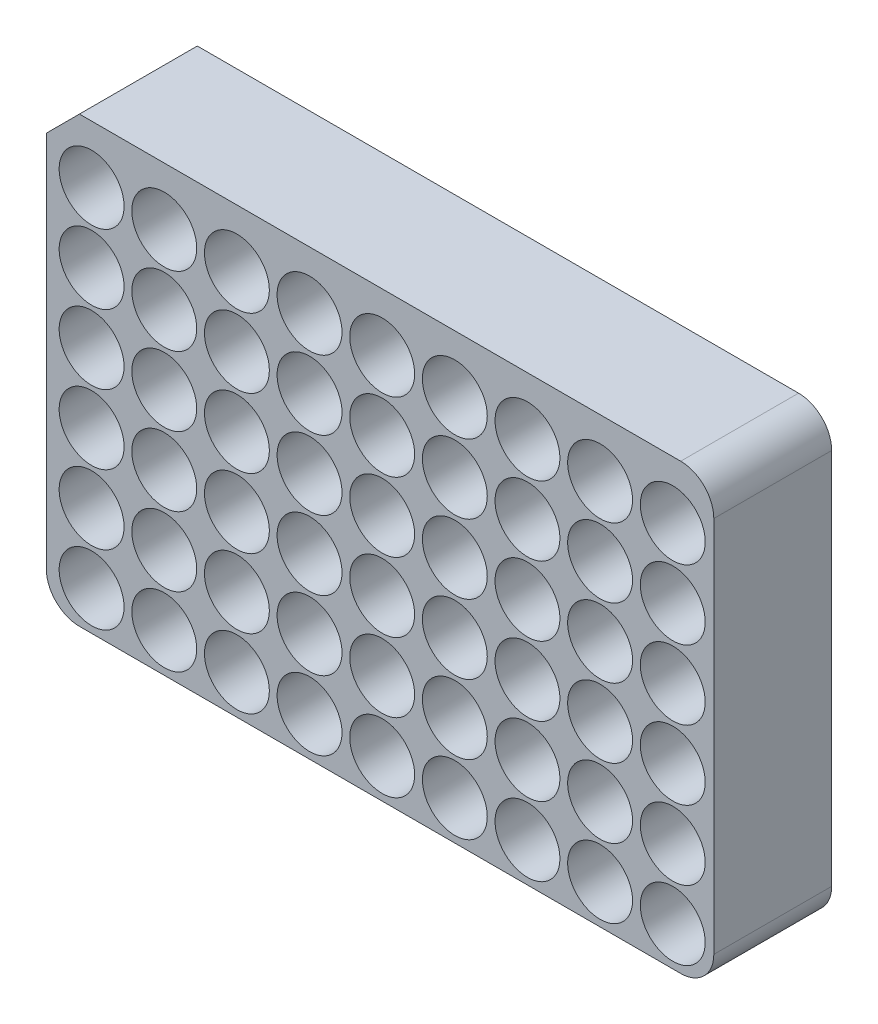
ISO-10303-21;
HEADER;
FILE_DESCRIPTION(('STEP AP214'),'2;1');
FILE_NAME('part.step','',(''),(''),'','','');
FILE_SCHEMA(('AUTOMOTIVE_DESIGN { 1 0 10303 214 1 1 1 1 }'));
ENDSEC;
DATA;
#1=APPLICATION_CONTEXT('core data for automotive mechanical design processes');
#2=APPLICATION_PROTOCOL_DEFINITION('international standard','automotive_design',2000,#1);
#3=PRODUCT_CONTEXT('',#1,'mechanical');
#4=PRODUCT('Part','Part','',(#3));
#5=PRODUCT_RELATED_PRODUCT_CATEGORY('part','',(#4));
#6=PRODUCT_DEFINITION_FORMATION('','',#4);
#7=PRODUCT_DEFINITION_CONTEXT('part definition',#1,'design');
#8=PRODUCT_DEFINITION('design','',#6,#7);
#9=PRODUCT_DEFINITION_SHAPE('','',#8);
#10=(LENGTH_UNIT() NAMED_UNIT(*) SI_UNIT(.MILLI.,.METRE.));
#11=(NAMED_UNIT(*) PLANE_ANGLE_UNIT() SI_UNIT($,.RADIAN.));
#12=(NAMED_UNIT(*) SI_UNIT($,.STERADIAN.) SOLID_ANGLE_UNIT());
#13=UNCERTAINTY_MEASURE_WITH_UNIT(LENGTH_MEASURE(1.E-05),#10,'distance_accuracy_value','');
#14=(GEOMETRIC_REPRESENTATION_CONTEXT(3) GLOBAL_UNCERTAINTY_ASSIGNED_CONTEXT((#13)) GLOBAL_UNIT_ASSIGNED_CONTEXT((#10,
#11,#12)) REPRESENTATION_CONTEXT('',''));
#15=CARTESIAN_POINT('',(0.,0.,0.));
#16=DIRECTION('',(0.,0.,1.));
#17=DIRECTION('',(1.,0.,0.));
#18=AXIS2_PLACEMENT_3D('',#15,#16,#17);
#19=CARTESIAN_POINT('',(-64.008,42.545,22.606));
#20=DIRECTION('',(1.,0.,0.));
#21=DIRECTION('',(0.,1.,0.));
#22=AXIS2_PLACEMENT_3D('',#19,#20,#21);
#23=PLANE('',#22);
#24=DIRECTION('',(0.,-1.,0.));
#25=VECTOR('',#24,1.);
#26=CARTESIAN_POINT('',(-64.008,42.545,22.606));
#27=LINE('',#26,#25);
#28=CARTESIAN_POINT('',(-64.008,36.195,22.606));
#29=VERTEX_POINT('',#28);
#30=CARTESIAN_POINT('',(-64.008,-36.195,22.606));
#31=VERTEX_POINT('',#30);
#32=EDGE_CURVE('E133',#29,#31,#27,.T.);
#33=ORIENTED_EDGE('',*,*,#32,.F.);
#34=DIRECTION('',(0.,0.,-1.));
#35=VECTOR('',#34,1.);
#36=CARTESIAN_POINT('',(-64.008,36.195,22.606));
#37=LINE('',#36,#35);
#38=CARTESIAN_POINT('',(-64.008,36.195,0.));
#39=VERTEX_POINT('',#38);
#40=EDGE_CURVE('E315',#29,#39,#37,.T.);
#41=ORIENTED_EDGE('',*,*,#40,.T.);
#42=DIRECTION('',(0.,-1.,0.));
#43=VECTOR('',#42,1.);
#44=CARTESIAN_POINT('',(-64.008,42.545,0.));
#45=LINE('',#44,#43);
#46=CARTESIAN_POINT('',(-64.008,-36.195,0.));
#47=VERTEX_POINT('',#46);
#48=EDGE_CURVE('E123',#39,#47,#45,.T.);
#49=ORIENTED_EDGE('',*,*,#48,.T.);
#50=DIRECTION('',(0.,0.,-1.));
#51=VECTOR('',#50,1.);
#52=CARTESIAN_POINT('',(-64.008,-36.195,22.606));
#53=LINE('',#52,#51);
#54=EDGE_CURVE('E105',#47,#31,#53,.F.);
#55=ORIENTED_EDGE('',*,*,#54,.T.);
#56=EDGE_LOOP('',(#33,#41,#49,#55));
#57=FACE_BOUND('',#56,.T.);
#58=ADVANCED_FACE('F33',(#57),#23,.F.);
#59=CARTESIAN_POINT('',(-64.008,-42.545,22.606));
#60=DIRECTION('',(0.,1.,0.));
#61=DIRECTION('',(0.,0.,1.));
#62=AXIS2_PLACEMENT_3D('',#59,#60,#61);
#63=PLANE('',#62);
#64=DIRECTION('',(1.,0.,0.));
#65=VECTOR('',#64,1.);
#66=CARTESIAN_POINT('',(-64.008,-42.545,22.606));
#67=LINE('',#66,#65);
#68=CARTESIAN_POINT('',(-57.658,-42.545,22.606));
#69=VERTEX_POINT('',#68);
#70=CARTESIAN_POINT('',(57.658,-42.545,22.606));
#71=VERTEX_POINT('',#70);
#72=EDGE_CURVE('E116',#69,#71,#67,.T.);
#73=ORIENTED_EDGE('',*,*,#72,.F.);
#74=DIRECTION('',(0.,0.,-1.));
#75=VECTOR('',#74,1.);
#76=CARTESIAN_POINT('',(-57.658,-42.545,22.606));
#77=LINE('',#76,#75);
#78=CARTESIAN_POINT('',(-57.658,-42.545,0.));
#79=VERTEX_POINT('',#78);
#80=EDGE_CURVE('E103',#69,#79,#77,.T.);
#81=ORIENTED_EDGE('',*,*,#80,.T.);
#82=DIRECTION('',(1.,0.,0.));
#83=VECTOR('',#82,1.);
#84=CARTESIAN_POINT('',(-64.008,-42.545,0.));
#85=LINE('',#84,#83);
#86=CARTESIAN_POINT('',(57.658,-42.545,0.));
#87=VERTEX_POINT('',#86);
#88=EDGE_CURVE('E113',#79,#87,#85,.T.);
#89=ORIENTED_EDGE('',*,*,#88,.T.);
#90=DIRECTION('',(0.,0.,-1.));
#91=VECTOR('',#90,1.);
#92=CARTESIAN_POINT('',(57.658,-42.545,22.606));
#93=LINE('',#92,#91);
#94=EDGE_CURVE('E118',#87,#71,#93,.F.);
#95=ORIENTED_EDGE('',*,*,#94,.T.);
#96=EDGE_LOOP('',(#73,#81,#89,#95));
#97=FACE_BOUND('',#96,.T.);
#98=ADVANCED_FACE('F112',(#97),#63,.F.);
#99=CARTESIAN_POINT('',(64.008,42.545,22.606));
#100=DIRECTION('',(-1.,0.,0.));
#101=DIRECTION('',(0.,-1.,0.));
#102=AXIS2_PLACEMENT_3D('',#99,#100,#101);
#103=PLANE('',#102);
#104=DIRECTION('',(0.,1.,0.));
#105=VECTOR('',#104,1.);
#106=CARTESIAN_POINT('',(64.008,42.545,22.606));
#107=LINE('',#106,#105);
#108=CARTESIAN_POINT('',(64.008,-36.195,22.606));
#109=VERTEX_POINT('',#108);
#110=CARTESIAN_POINT('',(64.008,36.195,22.606));
#111=VERTEX_POINT('',#110);
#112=EDGE_CURVE('E329',#109,#111,#107,.T.);
#113=ORIENTED_EDGE('',*,*,#112,.F.);
#114=DIRECTION('',(0.,0.,-1.));
#115=VECTOR('',#114,1.);
#116=CARTESIAN_POINT('',(64.008,-36.195,22.606));
#117=LINE('',#116,#115);
#118=CARTESIAN_POINT('',(64.008,-36.195,0.));
#119=VERTEX_POINT('',#118);
#120=EDGE_CURVE('E147',#109,#119,#117,.T.);
#121=ORIENTED_EDGE('',*,*,#120,.T.);
#122=DIRECTION('',(0.,1.,0.));
#123=VECTOR('',#122,1.);
#124=CARTESIAN_POINT('',(64.008,42.545,0.));
#125=LINE('',#124,#123);
#126=CARTESIAN_POINT('',(64.008,36.195,0.));
#127=VERTEX_POINT('',#126);
#128=EDGE_CURVE('E122',#119,#127,#125,.T.);
#129=ORIENTED_EDGE('',*,*,#128,.T.);
#130=DIRECTION('',(0.,0.,-1.));
#131=VECTOR('',#130,1.);
#132=CARTESIAN_POINT('',(64.008,36.195,22.606));
#133=LINE('',#132,#131);
#134=EDGE_CURVE('E145',#127,#111,#133,.F.);
#135=ORIENTED_EDGE('',*,*,#134,.T.);
#136=EDGE_LOOP('',(#113,#121,#129,#135));
#137=FACE_BOUND('',#136,.T.);
#138=ADVANCED_FACE('F583',(#137),#103,.F.);
#139=CARTESIAN_POINT('',(-64.008,42.545,22.606));
#140=DIRECTION('',(0.,-1.,0.));
#141=DIRECTION('',(0.,0.,-1.));
#142=AXIS2_PLACEMENT_3D('',#139,#140,#141);
#143=PLANE('',#142);
#144=DIRECTION('',(-1.,0.,0.));
#145=VECTOR('',#144,1.);
#146=CARTESIAN_POINT('',(-64.008,42.545,0.));
#147=LINE('',#146,#145);
#148=CARTESIAN_POINT('',(57.658,42.545,0.));
#149=VERTEX_POINT('',#148);
#150=CARTESIAN_POINT('',(-57.658,42.545,0.));
#151=VERTEX_POINT('',#150);
#152=EDGE_CURVE('E126',#149,#151,#147,.T.);
#153=ORIENTED_EDGE('',*,*,#152,.T.);
#154=DIRECTION('',(0.,0.,1.));
#155=VECTOR('',#154,1.);
#156=CARTESIAN_POINT('',(-57.658,42.545,22.606));
#157=LINE('',#156,#155);
#158=CARTESIAN_POINT('',(-57.658,42.545,22.606));
#159=VERTEX_POINT('',#158);
#160=EDGE_CURVE('E41',#151,#159,#157,.T.);
#161=ORIENTED_EDGE('',*,*,#160,.T.);
#162=DIRECTION('',(-1.,0.,0.));
#163=VECTOR('',#162,1.);
#164=CARTESIAN_POINT('',(-64.008,42.545,22.606));
#165=LINE('',#164,#163);
#166=CARTESIAN_POINT('',(57.658,42.545,22.606));
#167=VERTEX_POINT('',#166);
#168=EDGE_CURVE('E134',#167,#159,#165,.T.);
#169=ORIENTED_EDGE('',*,*,#168,.F.);
#170=DIRECTION('',(0.,0.,-1.));
#171=VECTOR('',#170,1.);
#172=CARTESIAN_POINT('',(57.658,42.545,22.606));
#173=LINE('',#172,#171);
#174=EDGE_CURVE('E150',#167,#149,#173,.T.);
#175=ORIENTED_EDGE('',*,*,#174,.T.);
#176=EDGE_LOOP('',(#153,#161,#169,#175));
#177=FACE_BOUND('',#176,.T.);
#178=ADVANCED_FACE('F507',(#177),#143,.F.);
#179=CARTESIAN_POINT('',(0.,0.,22.606));
#180=DIRECTION('',(0.,0.,1.));
#181=DIRECTION('',(1.,0.,0.));
#182=AXIS2_PLACEMENT_3D('',#179,#180,#181);
#183=PLANE('',#182);
#184=CARTESIAN_POINT('',(56.134,-35.052,22.606));
#185=DIRECTION('',(0.,0.,1.));
#186=DIRECTION('',(1.,0.,0.));
#187=AXIS2_PLACEMENT_3D('',#184,#185,#186);
#188=CIRCLE('',#187,6.22300000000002);
#189=CARTESIAN_POINT('',(62.357,-35.052,22.606));
#190=VERTEX_POINT('',#189);
#191=EDGE_CURVE('E490',#190,#190,#188,.T.);
#192=ORIENTED_EDGE('',*,*,#191,.F.);
#193=EDGE_LOOP('',(#192));
#194=FACE_BOUND('',#193,.T.);
#195=CARTESIAN_POINT('',(56.134,-21.7424,22.606));
#196=DIRECTION('',(0.,0.,1.));
#197=DIRECTION('',(1.,0.,0.));
#198=AXIS2_PLACEMENT_3D('',#195,#196,#197);
#199=CIRCLE('',#198,6.22300000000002);
#200=CARTESIAN_POINT('',(62.357,-21.7424,22.606));
#201=VERTEX_POINT('',#200);
#202=EDGE_CURVE('E484',#201,#201,#199,.T.);
#203=ORIENTED_EDGE('',*,*,#202,.F.);
#204=EDGE_LOOP('',(#203));
#205=FACE_BOUND('',#204,.T.);
#206=CARTESIAN_POINT('',(56.134,-8.4328,22.606));
#207=DIRECTION('',(0.,0.,1.));
#208=DIRECTION('',(1.,0.,0.));
#209=AXIS2_PLACEMENT_3D('',#206,#207,#208);
#210=CIRCLE('',#209,6.22300000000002);
#211=CARTESIAN_POINT('',(62.357,-8.4328,22.606));
#212=VERTEX_POINT('',#211);
#213=EDGE_CURVE('E478',#212,#212,#210,.T.);
#214=ORIENTED_EDGE('',*,*,#213,.F.);
#215=EDGE_LOOP('',(#214));
#216=FACE_BOUND('',#215,.T.);
#217=CARTESIAN_POINT('',(56.134,4.8768,22.606));
#218=DIRECTION('',(0.,0.,1.));
#219=DIRECTION('',(1.,0.,0.));
#220=AXIS2_PLACEMENT_3D('',#217,#218,#219);
#221=CIRCLE('',#220,6.22300000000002);
#222=CARTESIAN_POINT('',(62.357,4.8768,22.606));
#223=VERTEX_POINT('',#222);
#224=EDGE_CURVE('E472',#223,#223,#221,.T.);
#225=ORIENTED_EDGE('',*,*,#224,.F.);
#226=EDGE_LOOP('',(#225));
#227=FACE_BOUND('',#226,.T.);
#228=CARTESIAN_POINT('',(56.134,18.1864,22.606));
#229=DIRECTION('',(0.,0.,1.));
#230=DIRECTION('',(1.,0.,0.));
#231=AXIS2_PLACEMENT_3D('',#228,#229,#230);
#232=CIRCLE('',#231,6.22300000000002);
#233=CARTESIAN_POINT('',(62.357,18.1864,22.606));
#234=VERTEX_POINT('',#233);
#235=EDGE_CURVE('E466',#234,#234,#232,.T.);
#236=ORIENTED_EDGE('',*,*,#235,.F.);
#237=EDGE_LOOP('',(#236));
#238=FACE_BOUND('',#237,.T.);
#239=CARTESIAN_POINT('',(56.134,31.496,22.606));
#240=DIRECTION('',(0.,0.,1.));
#241=DIRECTION('',(1.,0.,0.));
#242=AXIS2_PLACEMENT_3D('',#239,#240,#241);
#243=CIRCLE('',#242,6.22300000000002);
#244=CARTESIAN_POINT('',(62.357,31.496,22.606));
#245=VERTEX_POINT('',#244);
#246=EDGE_CURVE('E460',#245,#245,#243,.T.);
#247=ORIENTED_EDGE('',*,*,#246,.F.);
#248=EDGE_LOOP('',(#247));
#249=FACE_BOUND('',#248,.T.);
#250=CARTESIAN_POINT('',(42.2021,-35.052,22.606));
#251=DIRECTION('',(0.,0.,1.));
#252=DIRECTION('',(1.,0.,0.));
#253=AXIS2_PLACEMENT_3D('',#250,#251,#252);
#254=CIRCLE('',#253,6.22300000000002);
#255=CARTESIAN_POINT('',(48.4251,-35.052,22.606));
#256=VERTEX_POINT('',#255);
#257=EDGE_CURVE('E454',#256,#256,#254,.T.);
#258=ORIENTED_EDGE('',*,*,#257,.F.);
#259=EDGE_LOOP('',(#258));
#260=FACE_BOUND('',#259,.T.);
#261=CARTESIAN_POINT('',(42.2021,31.496,22.606));
#262=DIRECTION('',(0.,0.,1.));
#263=DIRECTION('',(1.,0.,0.));
#264=AXIS2_PLACEMENT_3D('',#261,#262,#263);
#265=CIRCLE('',#264,6.22300000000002);
#266=CARTESIAN_POINT('',(48.4251,31.496,22.606));
#267=VERTEX_POINT('',#266);
#268=EDGE_CURVE('E448',#267,#267,#265,.T.);
#269=ORIENTED_EDGE('',*,*,#268,.F.);
#270=EDGE_LOOP('',(#269));
#271=FACE_BOUND('',#270,.T.);
#272=CARTESIAN_POINT('',(28.2702,-35.052,22.606));
#273=DIRECTION('',(0.,0.,1.));
#274=DIRECTION('',(1.,0.,0.));
#275=AXIS2_PLACEMENT_3D('',#272,#273,#274);
#276=CIRCLE('',#275,6.22300000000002);
#277=CARTESIAN_POINT('',(34.4932,-35.052,22.606));
#278=VERTEX_POINT('',#277);
#279=EDGE_CURVE('E442',#278,#278,#276,.T.);
#280=ORIENTED_EDGE('',*,*,#279,.F.);
#281=EDGE_LOOP('',(#280));
#282=FACE_BOUND('',#281,.T.);
#283=CARTESIAN_POINT('',(28.2702,31.496,22.606));
#284=DIRECTION('',(0.,0.,1.));
#285=DIRECTION('',(1.,0.,0.));
#286=AXIS2_PLACEMENT_3D('',#283,#284,#285);
#287=CIRCLE('',#286,6.22300000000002);
#288=CARTESIAN_POINT('',(34.4932,31.496,22.606));
#289=VERTEX_POINT('',#288);
#290=EDGE_CURVE('E436',#289,#289,#287,.T.);
#291=ORIENTED_EDGE('',*,*,#290,.F.);
#292=EDGE_LOOP('',(#291));
#293=FACE_BOUND('',#292,.T.);
#294=CARTESIAN_POINT('',(14.3383,-35.052,22.606));
#295=DIRECTION('',(0.,0.,1.));
#296=DIRECTION('',(1.,0.,0.));
#297=AXIS2_PLACEMENT_3D('',#294,#295,#296);
#298=CIRCLE('',#297,6.22300000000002);
#299=CARTESIAN_POINT('',(20.5613,-35.052,22.606));
#300=VERTEX_POINT('',#299);
#301=EDGE_CURVE('E430',#300,#300,#298,.T.);
#302=ORIENTED_EDGE('',*,*,#301,.F.);
#303=EDGE_LOOP('',(#302));
#304=FACE_BOUND('',#303,.T.);
#305=CARTESIAN_POINT('',(14.3383,31.496,22.606));
#306=DIRECTION('',(0.,0.,1.));
#307=DIRECTION('',(1.,0.,0.));
#308=AXIS2_PLACEMENT_3D('',#305,#306,#307);
#309=CIRCLE('',#308,6.22300000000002);
#310=CARTESIAN_POINT('',(20.5613,31.496,22.606));
#311=VERTEX_POINT('',#310);
#312=EDGE_CURVE('E424',#311,#311,#309,.T.);
#313=ORIENTED_EDGE('',*,*,#312,.F.);
#314=EDGE_LOOP('',(#313));
#315=FACE_BOUND('',#314,.T.);
#316=CARTESIAN_POINT('',(0.406399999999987,-35.052,22.606));
#317=DIRECTION('',(0.,0.,1.));
#318=DIRECTION('',(1.,0.,0.));
#319=AXIS2_PLACEMENT_3D('',#316,#317,#318);
#320=CIRCLE('',#319,6.22300000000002);
#321=CARTESIAN_POINT('',(6.6294,-35.052,22.606));
#322=VERTEX_POINT('',#321);
#323=EDGE_CURVE('E418',#322,#322,#320,.T.);
#324=ORIENTED_EDGE('',*,*,#323,.F.);
#325=EDGE_LOOP('',(#324));
#326=FACE_BOUND('',#325,.T.);
#327=CARTESIAN_POINT('',(0.406400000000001,31.496,22.606));
#328=DIRECTION('',(0.,0.,1.));
#329=DIRECTION('',(1.,0.,0.));
#330=AXIS2_PLACEMENT_3D('',#327,#328,#329);
#331=CIRCLE('',#330,6.22300000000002);
#332=CARTESIAN_POINT('',(6.62940000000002,31.496,22.606));
#333=VERTEX_POINT('',#332);
#334=EDGE_CURVE('E412',#333,#333,#331,.T.);
#335=ORIENTED_EDGE('',*,*,#334,.F.);
#336=EDGE_LOOP('',(#335));
#337=FACE_BOUND('',#336,.T.);
#338=CARTESIAN_POINT('',(-13.5255,-35.052,22.606));
#339=DIRECTION('',(0.,0.,1.));
#340=DIRECTION('',(1.,0.,0.));
#341=AXIS2_PLACEMENT_3D('',#338,#339,#340);
#342=CIRCLE('',#341,6.22300000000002);
#343=CARTESIAN_POINT('',(-7.30249999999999,-35.052,22.606));
#344=VERTEX_POINT('',#343);
#345=EDGE_CURVE('E406',#344,#344,#342,.T.);
#346=ORIENTED_EDGE('',*,*,#345,.F.);
#347=EDGE_LOOP('',(#346));
#348=FACE_BOUND('',#347,.T.);
#349=CARTESIAN_POINT('',(-13.5255,31.496,22.606));
#350=DIRECTION('',(0.,0.,1.));
#351=DIRECTION('',(1.,0.,0.));
#352=AXIS2_PLACEMENT_3D('',#349,#350,#351);
#353=CIRCLE('',#352,6.22300000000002);
#354=CARTESIAN_POINT('',(-7.30249999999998,31.496,22.606));
#355=VERTEX_POINT('',#354);
#356=EDGE_CURVE('E400',#355,#355,#353,.T.);
#357=ORIENTED_EDGE('',*,*,#356,.F.);
#358=EDGE_LOOP('',(#357));
#359=FACE_BOUND('',#358,.T.);
#360=CARTESIAN_POINT('',(-27.4574,-35.052,22.606));
#361=DIRECTION('',(0.,0.,1.));
#362=DIRECTION('',(1.,0.,0.));
#363=AXIS2_PLACEMENT_3D('',#360,#361,#362);
#364=CIRCLE('',#363,6.22300000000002);
#365=CARTESIAN_POINT('',(-21.2344,-35.052,22.606));
#366=VERTEX_POINT('',#365);
#367=EDGE_CURVE('E394',#366,#366,#364,.T.);
#368=ORIENTED_EDGE('',*,*,#367,.F.);
#369=EDGE_LOOP('',(#368));
#370=FACE_BOUND('',#369,.T.);
#371=CARTESIAN_POINT('',(-27.4574,31.496,22.606));
#372=DIRECTION('',(0.,0.,1.));
#373=DIRECTION('',(1.,0.,0.));
#374=AXIS2_PLACEMENT_3D('',#371,#372,#373);
#375=CIRCLE('',#374,6.22300000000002);
#376=CARTESIAN_POINT('',(-21.2344,31.496,22.606));
#377=VERTEX_POINT('',#376);
#378=EDGE_CURVE('E388',#377,#377,#375,.T.);
#379=ORIENTED_EDGE('',*,*,#378,.F.);
#380=EDGE_LOOP('',(#379));
#381=FACE_BOUND('',#380,.T.);
#382=CARTESIAN_POINT('',(-41.3893,-35.052,22.606));
#383=DIRECTION('',(0.,0.,1.));
#384=DIRECTION('',(1.,0.,0.));
#385=AXIS2_PLACEMENT_3D('',#382,#383,#384);
#386=CIRCLE('',#385,6.22300000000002);
#387=CARTESIAN_POINT('',(-35.1663,-35.052,22.606));
#388=VERTEX_POINT('',#387);
#389=EDGE_CURVE('E382',#388,#388,#386,.T.);
#390=ORIENTED_EDGE('',*,*,#389,.F.);
#391=EDGE_LOOP('',(#390));
#392=FACE_BOUND('',#391,.T.);
#393=CARTESIAN_POINT('',(-41.3893,31.496,22.606));
#394=DIRECTION('',(0.,0.,1.));
#395=DIRECTION('',(1.,0.,0.));
#396=AXIS2_PLACEMENT_3D('',#393,#394,#395);
#397=CIRCLE('',#396,6.22300000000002);
#398=CARTESIAN_POINT('',(-35.1663,31.496,22.606));
#399=VERTEX_POINT('',#398);
#400=EDGE_CURVE('E376',#399,#399,#397,.T.);
#401=ORIENTED_EDGE('',*,*,#400,.F.);
#402=EDGE_LOOP('',(#401));
#403=FACE_BOUND('',#402,.T.);
#404=CARTESIAN_POINT('',(-55.3212,-35.052,22.606));
#405=DIRECTION('',(0.,0.,1.));
#406=DIRECTION('',(1.,0.,0.));
#407=AXIS2_PLACEMENT_3D('',#404,#405,#406);
#408=CIRCLE('',#407,6.22300000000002);
#409=CARTESIAN_POINT('',(-49.0982,-35.052,22.606));
#410=VERTEX_POINT('',#409);
#411=EDGE_CURVE('E370',#410,#410,#408,.T.);
#412=ORIENTED_EDGE('',*,*,#411,.F.);
#413=EDGE_LOOP('',(#412));
#414=FACE_BOUND('',#413,.T.);
#415=CARTESIAN_POINT('',(-55.3212,-21.7424,22.606));
#416=DIRECTION('',(0.,0.,1.));
#417=DIRECTION('',(1.,0.,0.));
#418=AXIS2_PLACEMENT_3D('',#415,#416,#417);
#419=CIRCLE('',#418,6.22300000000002);
#420=CARTESIAN_POINT('',(-49.0982,-21.7424,22.606));
#421=VERTEX_POINT('',#420);
#422=EDGE_CURVE('E364',#421,#421,#419,.T.);
#423=ORIENTED_EDGE('',*,*,#422,.F.);
#424=EDGE_LOOP('',(#423));
#425=FACE_BOUND('',#424,.T.);
#426=CARTESIAN_POINT('',(-55.3212,-8.4328,22.606));
#427=DIRECTION('',(0.,0.,1.));
#428=DIRECTION('',(1.,0.,0.));
#429=AXIS2_PLACEMENT_3D('',#426,#427,#428);
#430=CIRCLE('',#429,6.22300000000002);
#431=CARTESIAN_POINT('',(-49.0982,-8.4328,22.606));
#432=VERTEX_POINT('',#431);
#433=EDGE_CURVE('E358',#432,#432,#430,.T.);
#434=ORIENTED_EDGE('',*,*,#433,.F.);
#435=EDGE_LOOP('',(#434));
#436=FACE_BOUND('',#435,.T.);
#437=CARTESIAN_POINT('',(-55.3212,4.8768,22.606));
#438=DIRECTION('',(0.,0.,1.));
#439=DIRECTION('',(1.,0.,0.));
#440=AXIS2_PLACEMENT_3D('',#437,#438,#439);
#441=CIRCLE('',#440,6.22300000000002);
#442=CARTESIAN_POINT('',(-49.0982,4.8768,22.606));
#443=VERTEX_POINT('',#442);
#444=EDGE_CURVE('E352',#443,#443,#441,.T.);
#445=ORIENTED_EDGE('',*,*,#444,.F.);
#446=EDGE_LOOP('',(#445));
#447=FACE_BOUND('',#446,.T.);
#448=CARTESIAN_POINT('',(-55.3212,18.1864,22.606));
#449=DIRECTION('',(0.,0.,1.));
#450=DIRECTION('',(1.,0.,0.));
#451=AXIS2_PLACEMENT_3D('',#448,#449,#450);
#452=CIRCLE('',#451,6.22300000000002);
#453=CARTESIAN_POINT('',(-49.0982,18.1864,22.606));
#454=VERTEX_POINT('',#453);
#455=EDGE_CURVE('E346',#454,#454,#452,.T.);
#456=ORIENTED_EDGE('',*,*,#455,.F.);
#457=EDGE_LOOP('',(#456));
#458=FACE_BOUND('',#457,.T.);
#459=CARTESIAN_POINT('',(-41.3893,18.1864,22.606));
#460=DIRECTION('',(0.,0.,1.));
#461=DIRECTION('',(1.,0.,0.));
#462=AXIS2_PLACEMENT_3D('',#459,#460,#461);
#463=CIRCLE('',#462,6.22300000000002);
#464=CARTESIAN_POINT('',(-35.1663,18.1864,22.606));
#465=VERTEX_POINT('',#464);
#466=EDGE_CURVE('E342',#465,#465,#463,.T.);
#467=ORIENTED_EDGE('',*,*,#466,.F.);
#468=EDGE_LOOP('',(#467));
#469=FACE_BOUND('',#468,.T.);
#470=CARTESIAN_POINT('',(-55.3212,31.496,22.606));
#471=DIRECTION('',(0.,0.,1.));
#472=DIRECTION('',(1.,0.,0.));
#473=AXIS2_PLACEMENT_3D('',#470,#471,#472);
#474=CIRCLE('',#473,6.22300000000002);
#475=CARTESIAN_POINT('',(-49.0982,31.496,22.606));
#476=VERTEX_POINT('',#475);
#477=EDGE_CURVE('E334',#476,#476,#474,.T.);
#478=ORIENTED_EDGE('',*,*,#477,.F.);
#479=EDGE_LOOP('',(#478));
#480=FACE_BOUND('',#479,.T.);
#481=ORIENTED_EDGE('',*,*,#168,.T.);
#482=DIRECTION('',(0.707106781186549,0.707106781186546,0.));
#483=VECTOR('',#482,1.);
#484=CARTESIAN_POINT('',(-50.1014999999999,50.1015000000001,22.606));
#485=LINE('',#484,#483);
#486=EDGE_CURVE('E11',#159,#29,#485,.F.);
#487=ORIENTED_EDGE('',*,*,#486,.T.);
#488=ORIENTED_EDGE('',*,*,#32,.T.);
#489=CARTESIAN_POINT('',(-57.658,-36.195,22.606));
#490=DIRECTION('',(0.,0.,1.));
#491=DIRECTION('',(1.,0.,0.));
#492=AXIS2_PLACEMENT_3D('',#489,#490,#491);
#493=CIRCLE('',#492,6.35);
#494=EDGE_CURVE('E143',#31,#69,#493,.T.);
#495=ORIENTED_EDGE('',*,*,#494,.T.);
#496=ORIENTED_EDGE('',*,*,#72,.T.);
#497=CARTESIAN_POINT('',(57.658,-36.195,22.606));
#498=DIRECTION('',(0.,0.,1.));
#499=DIRECTION('',(1.,0.,0.));
#500=AXIS2_PLACEMENT_3D('',#497,#498,#499);
#501=CIRCLE('',#500,6.35);
#502=EDGE_CURVE('E141',#71,#109,#501,.T.);
#503=ORIENTED_EDGE('',*,*,#502,.T.);
#504=ORIENTED_EDGE('',*,*,#112,.T.);
#505=CARTESIAN_POINT('',(57.658,36.195,22.606));
#506=DIRECTION('',(0.,0.,1.));
#507=DIRECTION('',(1.,0.,0.));
#508=AXIS2_PLACEMENT_3D('',#505,#506,#507);
#509=CIRCLE('',#508,6.35);
#510=EDGE_CURVE('E139',#111,#167,#509,.T.);
#511=ORIENTED_EDGE('',*,*,#510,.T.);
#512=EDGE_LOOP('',(#481,#487,#488,#495,#496,#503,#504,#511));
#513=FACE_BOUND('',#512,.T.);
#514=CARTESIAN_POINT('',(-27.4574,18.1864,22.606));
#515=DIRECTION('',(0.,0.,1.));
#516=DIRECTION('',(1.,0.,0.));
#517=AXIS2_PLACEMENT_3D('',#514,#515,#516);
#518=CIRCLE('',#517,6.22300000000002);
#519=CARTESIAN_POINT('',(-21.2344,18.1864,22.606));
#520=VERTEX_POINT('',#519);
#521=EDGE_CURVE('E153',#520,#520,#518,.T.);
#522=ORIENTED_EDGE('',*,*,#521,.F.);
#523=EDGE_LOOP('',(#522));
#524=FACE_BOUND('',#523,.T.);
#525=CARTESIAN_POINT('',(-13.5255,18.1864,22.606));
#526=DIRECTION('',(0.,0.,1.));
#527=DIRECTION('',(1.,0.,0.));
#528=AXIS2_PLACEMENT_3D('',#525,#526,#527);
#529=CIRCLE('',#528,6.22300000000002);
#530=CARTESIAN_POINT('',(-7.30249999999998,18.1864,22.606));
#531=VERTEX_POINT('',#530);
#532=EDGE_CURVE('E159',#531,#531,#529,.T.);
#533=ORIENTED_EDGE('',*,*,#532,.F.);
#534=EDGE_LOOP('',(#533));
#535=FACE_BOUND('',#534,.T.);
#536=CARTESIAN_POINT('',(0.406400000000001,18.1864,22.606));
#537=DIRECTION('',(0.,0.,1.));
#538=DIRECTION('',(1.,0.,0.));
#539=AXIS2_PLACEMENT_3D('',#536,#537,#538);
#540=CIRCLE('',#539,6.22300000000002);
#541=CARTESIAN_POINT('',(6.62940000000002,18.1864,22.606));
#542=VERTEX_POINT('',#541);
#543=EDGE_CURVE('E165',#542,#542,#540,.T.);
#544=ORIENTED_EDGE('',*,*,#543,.F.);
#545=EDGE_LOOP('',(#544));
#546=FACE_BOUND('',#545,.T.);
#547=CARTESIAN_POINT('',(14.3383,18.1864,22.606));
#548=DIRECTION('',(0.,0.,1.));
#549=DIRECTION('',(1.,0.,0.));
#550=AXIS2_PLACEMENT_3D('',#547,#548,#549);
#551=CIRCLE('',#550,6.22300000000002);
#552=CARTESIAN_POINT('',(20.5613,18.1864,22.606));
#553=VERTEX_POINT('',#552);
#554=EDGE_CURVE('E171',#553,#553,#551,.T.);
#555=ORIENTED_EDGE('',*,*,#554,.F.);
#556=EDGE_LOOP('',(#555));
#557=FACE_BOUND('',#556,.T.);
#558=CARTESIAN_POINT('',(28.2702,18.1864,22.606));
#559=DIRECTION('',(0.,0.,1.));
#560=DIRECTION('',(1.,0.,0.));
#561=AXIS2_PLACEMENT_3D('',#558,#559,#560);
#562=CIRCLE('',#561,6.22300000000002);
#563=CARTESIAN_POINT('',(34.4932,18.1864,22.606));
#564=VERTEX_POINT('',#563);
#565=EDGE_CURVE('E177',#564,#564,#562,.T.);
#566=ORIENTED_EDGE('',*,*,#565,.F.);
#567=EDGE_LOOP('',(#566));
#568=FACE_BOUND('',#567,.T.);
#569=CARTESIAN_POINT('',(42.2021,18.1864,22.606));
#570=DIRECTION('',(0.,0.,1.));
#571=DIRECTION('',(1.,0.,0.));
#572=AXIS2_PLACEMENT_3D('',#569,#570,#571);
#573=CIRCLE('',#572,6.22300000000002);
#574=CARTESIAN_POINT('',(48.4251,18.1864,22.606));
#575=VERTEX_POINT('',#574);
#576=EDGE_CURVE('E183',#575,#575,#573,.T.);
#577=ORIENTED_EDGE('',*,*,#576,.F.);
#578=EDGE_LOOP('',(#577));
#579=FACE_BOUND('',#578,.T.);
#580=CARTESIAN_POINT('',(-41.3893,4.8768,22.606));
#581=DIRECTION('',(0.,0.,1.));
#582=DIRECTION('',(1.,0.,0.));
#583=AXIS2_PLACEMENT_3D('',#580,#581,#582);
#584=CIRCLE('',#583,6.22300000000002);
#585=CARTESIAN_POINT('',(-35.1663,4.8768,22.606));
#586=VERTEX_POINT('',#585);
#587=EDGE_CURVE('E189',#586,#586,#584,.T.);
#588=ORIENTED_EDGE('',*,*,#587,.F.);
#589=EDGE_LOOP('',(#588));
#590=FACE_BOUND('',#589,.T.);
#591=CARTESIAN_POINT('',(-27.4574,4.8768,22.606));
#592=DIRECTION('',(0.,0.,1.));
#593=DIRECTION('',(1.,0.,0.));
#594=AXIS2_PLACEMENT_3D('',#591,#592,#593);
#595=CIRCLE('',#594,6.22300000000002);
#596=CARTESIAN_POINT('',(-21.2344,4.8768,22.606));
#597=VERTEX_POINT('',#596);
#598=EDGE_CURVE('E195',#597,#597,#595,.T.);
#599=ORIENTED_EDGE('',*,*,#598,.F.);
#600=EDGE_LOOP('',(#599));
#601=FACE_BOUND('',#600,.T.);
#602=CARTESIAN_POINT('',(-13.5255,4.8768,22.606));
#603=DIRECTION('',(0.,0.,1.));
#604=DIRECTION('',(1.,0.,0.));
#605=AXIS2_PLACEMENT_3D('',#602,#603,#604);
#606=CIRCLE('',#605,6.22300000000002);
#607=CARTESIAN_POINT('',(-7.30249999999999,4.8768,22.606));
#608=VERTEX_POINT('',#607);
#609=EDGE_CURVE('E201',#608,#608,#606,.T.);
#610=ORIENTED_EDGE('',*,*,#609,.F.);
#611=EDGE_LOOP('',(#610));
#612=FACE_BOUND('',#611,.T.);
#613=CARTESIAN_POINT('',(0.406399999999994,4.8768,22.606));
#614=DIRECTION('',(0.,0.,1.));
#615=DIRECTION('',(1.,0.,0.));
#616=AXIS2_PLACEMENT_3D('',#613,#614,#615);
#617=CIRCLE('',#616,6.22300000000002);
#618=CARTESIAN_POINT('',(6.62940000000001,4.8768,22.606));
#619=VERTEX_POINT('',#618);
#620=EDGE_CURVE('E207',#619,#619,#617,.T.);
#621=ORIENTED_EDGE('',*,*,#620,.F.);
#622=EDGE_LOOP('',(#621));
#623=FACE_BOUND('',#622,.T.);
#624=CARTESIAN_POINT('',(14.3383,4.8768,22.606));
#625=DIRECTION('',(0.,0.,1.));
#626=DIRECTION('',(1.,0.,0.));
#627=AXIS2_PLACEMENT_3D('',#624,#625,#626);
#628=CIRCLE('',#627,6.22300000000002);
#629=CARTESIAN_POINT('',(20.5613,4.8768,22.606));
#630=VERTEX_POINT('',#629);
#631=EDGE_CURVE('E213',#630,#630,#628,.T.);
#632=ORIENTED_EDGE('',*,*,#631,.F.);
#633=EDGE_LOOP('',(#632));
#634=FACE_BOUND('',#633,.T.);
#635=CARTESIAN_POINT('',(28.2702,4.8768,22.606));
#636=DIRECTION('',(0.,0.,1.));
#637=DIRECTION('',(1.,0.,0.));
#638=AXIS2_PLACEMENT_3D('',#635,#636,#637);
#639=CIRCLE('',#638,6.22300000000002);
#640=CARTESIAN_POINT('',(34.4932,4.8768,22.606));
#641=VERTEX_POINT('',#640);
#642=EDGE_CURVE('E219',#641,#641,#639,.T.);
#643=ORIENTED_EDGE('',*,*,#642,.F.);
#644=EDGE_LOOP('',(#643));
#645=FACE_BOUND('',#644,.T.);
#646=CARTESIAN_POINT('',(42.2021,4.8768,22.606));
#647=DIRECTION('',(0.,0.,1.));
#648=DIRECTION('',(1.,0.,0.));
#649=AXIS2_PLACEMENT_3D('',#646,#647,#648);
#650=CIRCLE('',#649,6.22300000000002);
#651=CARTESIAN_POINT('',(48.4251,4.8768,22.606));
#652=VERTEX_POINT('',#651);
#653=EDGE_CURVE('E225',#652,#652,#650,.T.);
#654=ORIENTED_EDGE('',*,*,#653,.F.);
#655=EDGE_LOOP('',(#654));
#656=FACE_BOUND('',#655,.T.);
#657=CARTESIAN_POINT('',(-41.3893,-8.4328,22.606));
#658=DIRECTION('',(0.,0.,1.));
#659=DIRECTION('',(1.,0.,0.));
#660=AXIS2_PLACEMENT_3D('',#657,#658,#659);
#661=CIRCLE('',#660,6.22300000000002);
#662=CARTESIAN_POINT('',(-35.1663,-8.4328,22.606));
#663=VERTEX_POINT('',#662);
#664=EDGE_CURVE('E231',#663,#663,#661,.T.);
#665=ORIENTED_EDGE('',*,*,#664,.F.);
#666=EDGE_LOOP('',(#665));
#667=FACE_BOUND('',#666,.T.);
#668=CARTESIAN_POINT('',(-27.4574,-8.4328,22.606));
#669=DIRECTION('',(0.,0.,1.));
#670=DIRECTION('',(1.,0.,0.));
#671=AXIS2_PLACEMENT_3D('',#668,#669,#670);
#672=CIRCLE('',#671,6.22300000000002);
#673=CARTESIAN_POINT('',(-21.2344,-8.4328,22.606));
#674=VERTEX_POINT('',#673);
#675=EDGE_CURVE('E237',#674,#674,#672,.T.);
#676=ORIENTED_EDGE('',*,*,#675,.F.);
#677=EDGE_LOOP('',(#676));
#678=FACE_BOUND('',#677,.T.);
#679=CARTESIAN_POINT('',(-13.5255,-8.4328,22.606));
#680=DIRECTION('',(0.,0.,1.));
#681=DIRECTION('',(1.,0.,0.));
#682=AXIS2_PLACEMENT_3D('',#679,#680,#681);
#683=CIRCLE('',#682,6.22300000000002);
#684=CARTESIAN_POINT('',(-7.30249999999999,-8.4328,22.606));
#685=VERTEX_POINT('',#684);
#686=EDGE_CURVE('E243',#685,#685,#683,.T.);
#687=ORIENTED_EDGE('',*,*,#686,.F.);
#688=EDGE_LOOP('',(#687));
#689=FACE_BOUND('',#688,.T.);
#690=CARTESIAN_POINT('',(0.406399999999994,-8.4328,22.606));
#691=DIRECTION('',(0.,0.,1.));
#692=DIRECTION('',(1.,0.,0.));
#693=AXIS2_PLACEMENT_3D('',#690,#691,#692);
#694=CIRCLE('',#693,6.22300000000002);
#695=CARTESIAN_POINT('',(6.62940000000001,-8.4328,22.606));
#696=VERTEX_POINT('',#695);
#697=EDGE_CURVE('E249',#696,#696,#694,.T.);
#698=ORIENTED_EDGE('',*,*,#697,.F.);
#699=EDGE_LOOP('',(#698));
#700=FACE_BOUND('',#699,.T.);
#701=CARTESIAN_POINT('',(14.3383,-8.4328,22.606));
#702=DIRECTION('',(0.,0.,1.));
#703=DIRECTION('',(1.,0.,0.));
#704=AXIS2_PLACEMENT_3D('',#701,#702,#703);
#705=CIRCLE('',#704,6.22300000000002);
#706=CARTESIAN_POINT('',(20.5613,-8.4328,22.606));
#707=VERTEX_POINT('',#706);
#708=EDGE_CURVE('E255',#707,#707,#705,.T.);
#709=ORIENTED_EDGE('',*,*,#708,.F.);
#710=EDGE_LOOP('',(#709));
#711=FACE_BOUND('',#710,.T.);
#712=CARTESIAN_POINT('',(28.2702,-8.4328,22.606));
#713=DIRECTION('',(0.,0.,1.));
#714=DIRECTION('',(1.,0.,0.));
#715=AXIS2_PLACEMENT_3D('',#712,#713,#714);
#716=CIRCLE('',#715,6.22300000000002);
#717=CARTESIAN_POINT('',(34.4932,-8.4328,22.606));
#718=VERTEX_POINT('',#717);
#719=EDGE_CURVE('E261',#718,#718,#716,.T.);
#720=ORIENTED_EDGE('',*,*,#719,.F.);
#721=EDGE_LOOP('',(#720));
#722=FACE_BOUND('',#721,.T.);
#723=CARTESIAN_POINT('',(42.2021,-8.4328,22.606));
#724=DIRECTION('',(0.,0.,1.));
#725=DIRECTION('',(1.,0.,0.));
#726=AXIS2_PLACEMENT_3D('',#723,#724,#725);
#727=CIRCLE('',#726,6.22300000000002);
#728=CARTESIAN_POINT('',(48.4251,-8.4328,22.606));
#729=VERTEX_POINT('',#728);
#730=EDGE_CURVE('E267',#729,#729,#727,.T.);
#731=ORIENTED_EDGE('',*,*,#730,.F.);
#732=EDGE_LOOP('',(#731));
#733=FACE_BOUND('',#732,.T.);
#734=CARTESIAN_POINT('',(-41.3893,-21.7424,22.606));
#735=DIRECTION('',(0.,0.,1.));
#736=DIRECTION('',(1.,0.,0.));
#737=AXIS2_PLACEMENT_3D('',#734,#735,#736);
#738=CIRCLE('',#737,6.22300000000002);
#739=CARTESIAN_POINT('',(-35.1663,-21.7424,22.606));
#740=VERTEX_POINT('',#739);
#741=EDGE_CURVE('E273',#740,#740,#738,.T.);
#742=ORIENTED_EDGE('',*,*,#741,.F.);
#743=EDGE_LOOP('',(#742));
#744=FACE_BOUND('',#743,.T.);
#745=CARTESIAN_POINT('',(-27.4574,-21.7424,22.606));
#746=DIRECTION('',(0.,0.,1.));
#747=DIRECTION('',(1.,0.,0.));
#748=AXIS2_PLACEMENT_3D('',#745,#746,#747);
#749=CIRCLE('',#748,6.22300000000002);
#750=CARTESIAN_POINT('',(-21.2344,-21.7424,22.606));
#751=VERTEX_POINT('',#750);
#752=EDGE_CURVE('E279',#751,#751,#749,.T.);
#753=ORIENTED_EDGE('',*,*,#752,.F.);
#754=EDGE_LOOP('',(#753));
#755=FACE_BOUND('',#754,.T.);
#756=CARTESIAN_POINT('',(-13.5255,-21.7424,22.606));
#757=DIRECTION('',(0.,0.,1.));
#758=DIRECTION('',(1.,0.,0.));
#759=AXIS2_PLACEMENT_3D('',#756,#757,#758);
#760=CIRCLE('',#759,6.22300000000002);
#761=CARTESIAN_POINT('',(-7.30249999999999,-21.7424,22.606));
#762=VERTEX_POINT('',#761);
#763=EDGE_CURVE('E285',#762,#762,#760,.T.);
#764=ORIENTED_EDGE('',*,*,#763,.F.);
#765=EDGE_LOOP('',(#764));
#766=FACE_BOUND('',#765,.T.);
#767=CARTESIAN_POINT('',(0.406399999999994,-21.7424,22.606));
#768=DIRECTION('',(0.,0.,1.));
#769=DIRECTION('',(1.,0.,0.));
#770=AXIS2_PLACEMENT_3D('',#767,#768,#769);
#771=CIRCLE('',#770,6.22300000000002);
#772=CARTESIAN_POINT('',(6.62940000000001,-21.7424,22.606));
#773=VERTEX_POINT('',#772);
#774=EDGE_CURVE('E291',#773,#773,#771,.T.);
#775=ORIENTED_EDGE('',*,*,#774,.F.);
#776=EDGE_LOOP('',(#775));
#777=FACE_BOUND('',#776,.T.);
#778=CARTESIAN_POINT('',(14.3383,-21.7424,22.606));
#779=DIRECTION('',(0.,0.,1.));
#780=DIRECTION('',(1.,0.,0.));
#781=AXIS2_PLACEMENT_3D('',#778,#779,#780);
#782=CIRCLE('',#781,6.22300000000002);
#783=CARTESIAN_POINT('',(20.5613,-21.7424,22.606));
#784=VERTEX_POINT('',#783);
#785=EDGE_CURVE('E297',#784,#784,#782,.T.);
#786=ORIENTED_EDGE('',*,*,#785,.F.);
#787=EDGE_LOOP('',(#786));
#788=FACE_BOUND('',#787,.T.);
#789=CARTESIAN_POINT('',(28.2702,-21.7424,22.606));
#790=DIRECTION('',(0.,0.,1.));
#791=DIRECTION('',(1.,0.,0.));
#792=AXIS2_PLACEMENT_3D('',#789,#790,#791);
#793=CIRCLE('',#792,6.22300000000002);
#794=CARTESIAN_POINT('',(34.4932,-21.7424,22.606));
#795=VERTEX_POINT('',#794);
#796=EDGE_CURVE('E303',#795,#795,#793,.T.);
#797=ORIENTED_EDGE('',*,*,#796,.F.);
#798=EDGE_LOOP('',(#797));
#799=FACE_BOUND('',#798,.T.);
#800=CARTESIAN_POINT('',(42.2021,-21.7424,22.606));
#801=DIRECTION('',(0.,0.,1.));
#802=DIRECTION('',(1.,0.,0.));
#803=AXIS2_PLACEMENT_3D('',#800,#801,#802);
#804=CIRCLE('',#803,6.22300000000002);
#805=CARTESIAN_POINT('',(48.4251,-21.7424,22.606));
#806=VERTEX_POINT('',#805);
#807=EDGE_CURVE('E309',#806,#806,#804,.T.);
#808=ORIENTED_EDGE('',*,*,#807,.F.);
#809=EDGE_LOOP('',(#808));
#810=FACE_BOUND('',#809,.T.);
#811=ADVANCED_FACE('F324',(#194,#205,#216,#227,#238,#249,#260,#271,#282,#293,#304,#315,#326,
#337,#348,#359,#370,#381,#392,#403,#414,#425,#436,#447,#458,#469,#480,#513,#524,#535,#546,#557,
#568,#579,#590,#601,#612,#623,#634,#645,#656,#667,#678,#689,#700,#711,#722,#733,#744,#755,#766,
#777,#788,#799,#810),#183,.T.);
#812=CARTESIAN_POINT('',(0.,0.,0.));
#813=DIRECTION('',(0.,0.,1.));
#814=DIRECTION('',(1.,0.,0.));
#815=AXIS2_PLACEMENT_3D('',#812,#813,#814);
#816=PLANE('',#815);
#817=ORIENTED_EDGE('',*,*,#48,.F.);
#818=DIRECTION('',(-0.707106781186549,-0.707106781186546,0.));
#819=VECTOR('',#818,1.);
#820=CARTESIAN_POINT('',(-64.008,36.195,0.));
#821=LINE('',#820,#819);
#822=EDGE_CURVE('E55',#39,#151,#821,.F.);
#823=ORIENTED_EDGE('',*,*,#822,.T.);
#824=ORIENTED_EDGE('',*,*,#152,.F.);
#825=CARTESIAN_POINT('',(57.658,36.195,0.));
#826=DIRECTION('',(0.,0.,1.));
#827=DIRECTION('',(1.,0.,0.));
#828=AXIS2_PLACEMENT_3D('',#825,#826,#827);
#829=CIRCLE('',#828,6.35);
#830=EDGE_CURVE('E117',#149,#127,#829,.F.);
#831=ORIENTED_EDGE('',*,*,#830,.T.);
#832=ORIENTED_EDGE('',*,*,#128,.F.);
#833=CARTESIAN_POINT('',(57.658,-36.195,0.));
#834=DIRECTION('',(0.,0.,1.));
#835=DIRECTION('',(1.,0.,0.));
#836=AXIS2_PLACEMENT_3D('',#833,#834,#835);
#837=CIRCLE('',#836,6.35);
#838=EDGE_CURVE('E107',#119,#87,#837,.F.);
#839=ORIENTED_EDGE('',*,*,#838,.T.);
#840=ORIENTED_EDGE('',*,*,#88,.F.);
#841=CARTESIAN_POINT('',(-57.658,-36.195,0.));
#842=DIRECTION('',(0.,0.,1.));
#843=DIRECTION('',(1.,0.,0.));
#844=AXIS2_PLACEMENT_3D('',#841,#842,#843);
#845=CIRCLE('',#844,6.35);
#846=EDGE_CURVE('E99',#79,#47,#845,.F.);
#847=ORIENTED_EDGE('',*,*,#846,.T.);
#848=EDGE_LOOP('',(#817,#823,#824,#831,#832,#839,#840,#847));
#849=FACE_BOUND('',#848,.T.);
#850=ADVANCED_FACE('F120',(#849),#816,.F.);
#851=CARTESIAN_POINT('',(-57.658,-36.195,22.606));
#852=DIRECTION('',(0.,0.,-1.));
#853=DIRECTION('',(-1.,0.,0.));
#854=AXIS2_PLACEMENT_3D('',#851,#852,#853);
#855=CYLINDRICAL_SURFACE('',#854,6.35);
#856=ORIENTED_EDGE('',*,*,#494,.F.);
#857=ORIENTED_EDGE('',*,*,#54,.F.);
#858=ORIENTED_EDGE('',*,*,#846,.F.);
#859=ORIENTED_EDGE('',*,*,#80,.F.);
#860=EDGE_LOOP('',(#856,#857,#858,#859));
#861=FACE_BOUND('',#860,.T.);
#862=ADVANCED_FACE('F102',(#861),#855,.T.);
#863=CARTESIAN_POINT('',(57.658,-36.195,22.606));
#864=DIRECTION('',(0.,0.,-1.));
#865=DIRECTION('',(-1.,0.,0.));
#866=AXIS2_PLACEMENT_3D('',#863,#864,#865);
#867=CYLINDRICAL_SURFACE('',#866,6.35);
#868=ORIENTED_EDGE('',*,*,#502,.F.);
#869=ORIENTED_EDGE('',*,*,#94,.F.);
#870=ORIENTED_EDGE('',*,*,#838,.F.);
#871=ORIENTED_EDGE('',*,*,#120,.F.);
#872=EDGE_LOOP('',(#868,#869,#870,#871));
#873=FACE_BOUND('',#872,.T.);
#874=ADVANCED_FACE('F574',(#873),#867,.T.);
#875=CARTESIAN_POINT('',(57.658,36.195,22.606));
#876=DIRECTION('',(0.,0.,-1.));
#877=DIRECTION('',(-1.,0.,0.));
#878=AXIS2_PLACEMENT_3D('',#875,#876,#877);
#879=CYLINDRICAL_SURFACE('',#878,6.35);
#880=ORIENTED_EDGE('',*,*,#510,.F.);
#881=ORIENTED_EDGE('',*,*,#134,.F.);
#882=ORIENTED_EDGE('',*,*,#830,.F.);
#883=ORIENTED_EDGE('',*,*,#174,.F.);
#884=EDGE_LOOP('',(#880,#881,#882,#883));
#885=FACE_BOUND('',#884,.T.);
#886=ADVANCED_FACE('F564',(#885),#879,.T.);
#887=CARTESIAN_POINT('',(-55.3212,31.496,2.286));
#888=DIRECTION('',(0.,0.,1.));
#889=DIRECTION('',(1.,0.,0.));
#890=AXIS2_PLACEMENT_3D('',#887,#888,#889);
#891=CYLINDRICAL_SURFACE('',#890,6.22300000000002);
#892=CARTESIAN_POINT('',(-55.3212,31.496,2.286));
#893=DIRECTION('',(0.,0.,1.));
#894=DIRECTION('',(1.,0.,0.));
#895=AXIS2_PLACEMENT_3D('',#892,#893,#894);
#896=CIRCLE('',#895,6.22300000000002);
#897=CARTESIAN_POINT('',(-49.0982,31.496,2.286));
#898=VERTEX_POINT('',#897);
#899=EDGE_CURVE('E128',#898,#898,#896,.T.);
#900=ORIENTED_EDGE('',*,*,#899,.F.);
#901=EDGE_LOOP('',(#900));
#902=FACE_BOUND('',#901,.T.);
#903=ORIENTED_EDGE('',*,*,#477,.T.);
#904=EDGE_LOOP('',(#903));
#905=FACE_BOUND('',#904,.T.);
#906=ADVANCED_FACE('F561',(#902,#905),#891,.F.);
#907=CARTESIAN_POINT('',(-55.3212,31.496,2.286));
#908=DIRECTION('',(0.,0.,1.));
#909=DIRECTION('',(1.,0.,0.));
#910=AXIS2_PLACEMENT_3D('',#907,#908,#909);
#911=PLANE('',#910);
#912=ORIENTED_EDGE('',*,*,#899,.T.);
#913=EDGE_LOOP('',(#912));
#914=FACE_BOUND('',#913,.T.);
#915=ADVANCED_FACE('F563',(#914),#911,.T.);
#916=CARTESIAN_POINT('',(-41.3893,18.1864,2.286));
#917=DIRECTION('',(0.,0.,1.));
#918=DIRECTION('',(1.,0.,0.));
#919=AXIS2_PLACEMENT_3D('',#916,#917,#918);
#920=CYLINDRICAL_SURFACE('',#919,6.22300000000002);
#921=CARTESIAN_POINT('',(-41.3893,18.1864,2.286));
#922=DIRECTION('',(0.,0.,1.));
#923=DIRECTION('',(1.,0.,0.));
#924=AXIS2_PLACEMENT_3D('',#921,#922,#923);
#925=CIRCLE('',#924,6.22300000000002);
#926=CARTESIAN_POINT('',(-35.1663,18.1864,2.286));
#927=VERTEX_POINT('',#926);
#928=EDGE_CURVE('E337',#927,#927,#925,.T.);
#929=ORIENTED_EDGE('',*,*,#928,.F.);
#930=EDGE_LOOP('',(#929));
#931=FACE_BOUND('',#930,.T.);
#932=ORIENTED_EDGE('',*,*,#466,.T.);
#933=EDGE_LOOP('',(#932));
#934=FACE_BOUND('',#933,.T.);
#935=ADVANCED_FACE('F571',(#931,#934),#920,.F.);
#936=CARTESIAN_POINT('',(-41.3893,18.1864,2.286));
#937=DIRECTION('',(0.,0.,1.));
#938=DIRECTION('',(1.,0.,0.));
#939=AXIS2_PLACEMENT_3D('',#936,#937,#938);
#940=PLANE('',#939);
#941=ORIENTED_EDGE('',*,*,#928,.T.);
#942=EDGE_LOOP('',(#941));
#943=FACE_BOUND('',#942,.T.);
#944=ADVANCED_FACE('F600',(#943),#940,.T.);
#945=CARTESIAN_POINT('',(-27.4574,18.1864,2.286));
#946=DIRECTION('',(0.,0.,1.));
#947=DIRECTION('',(1.,0.,0.));
#948=AXIS2_PLACEMENT_3D('',#945,#946,#947);
#949=PLANE('',#948);
#950=CARTESIAN_POINT('',(-27.4574,18.1864,2.286));
#951=DIRECTION('',(0.,0.,1.));
#952=DIRECTION('',(1.,0.,0.));
#953=AXIS2_PLACEMENT_3D('',#950,#951,#952);
#954=CIRCLE('',#953,6.22300000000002);
#955=CARTESIAN_POINT('',(-21.2344,18.1864,2.286));
#956=VERTEX_POINT('',#955);
#957=EDGE_CURVE('E156',#956,#956,#954,.T.);
#958=ORIENTED_EDGE('',*,*,#957,.T.);
#959=EDGE_LOOP('',(#958));
#960=FACE_BOUND('',#959,.T.);
#961=ADVANCED_FACE('F596',(#960),#949,.T.);
#962=CARTESIAN_POINT('',(-27.4574,18.1864,2.286));
#963=DIRECTION('',(0.,0.,1.));
#964=DIRECTION('',(1.,0.,0.));
#965=AXIS2_PLACEMENT_3D('',#962,#963,#964);
#966=CYLINDRICAL_SURFACE('',#965,6.22300000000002);
#967=ORIENTED_EDGE('',*,*,#957,.F.);
#968=EDGE_LOOP('',(#967));
#969=FACE_BOUND('',#968,.T.);
#970=ORIENTED_EDGE('',*,*,#521,.T.);
#971=EDGE_LOOP('',(#970));
#972=FACE_BOUND('',#971,.T.);
#973=ADVANCED_FACE('F592',(#969,#972),#966,.F.);
#974=CARTESIAN_POINT('',(-13.5255,18.1864,2.286));
#975=DIRECTION('',(0.,0.,1.));
#976=DIRECTION('',(1.,0.,0.));
#977=AXIS2_PLACEMENT_3D('',#974,#975,#976);
#978=PLANE('',#977);
#979=CARTESIAN_POINT('',(-13.5255,18.1864,2.286));
#980=DIRECTION('',(0.,0.,1.));
#981=DIRECTION('',(1.,0.,0.));
#982=AXIS2_PLACEMENT_3D('',#979,#980,#981);
#983=CIRCLE('',#982,6.22300000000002);
#984=CARTESIAN_POINT('',(-7.30249999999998,18.1864,2.286));
#985=VERTEX_POINT('',#984);
#986=EDGE_CURVE('E162',#985,#985,#983,.T.);
#987=ORIENTED_EDGE('',*,*,#986,.T.);
#988=EDGE_LOOP('',(#987));
#989=FACE_BOUND('',#988,.T.);
#990=ADVANCED_FACE('F595',(#989),#978,.T.);
#991=CARTESIAN_POINT('',(-13.5255,18.1864,2.286));
#992=DIRECTION('',(0.,0.,1.));
#993=DIRECTION('',(1.,0.,0.));
#994=AXIS2_PLACEMENT_3D('',#991,#992,#993);
#995=CYLINDRICAL_SURFACE('',#994,6.22300000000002);
#996=ORIENTED_EDGE('',*,*,#986,.F.);
#997=EDGE_LOOP('',(#996));
#998=FACE_BOUND('',#997,.T.);
#999=ORIENTED_EDGE('',*,*,#532,.T.);
#1000=EDGE_LOOP('',(#999));
#1001=FACE_BOUND('',#1000,.T.);
#1002=ADVANCED_FACE('F602',(#998,#1001),#995,.F.);
#1003=CARTESIAN_POINT('',(0.406400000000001,18.1864,2.286));
#1004=DIRECTION('',(0.,0.,1.));
#1005=DIRECTION('',(1.,0.,0.));
#1006=AXIS2_PLACEMENT_3D('',#1003,#1004,#1005);
#1007=PLANE('',#1006);
#1008=CARTESIAN_POINT('',(0.406400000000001,18.1864,2.286));
#1009=DIRECTION('',(0.,0.,1.));
#1010=DIRECTION('',(1.,0.,0.));
#1011=AXIS2_PLACEMENT_3D('',#1008,#1009,#1010);
#1012=CIRCLE('',#1011,6.22300000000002);
#1013=CARTESIAN_POINT('',(6.62940000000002,18.1864,2.286));
#1014=VERTEX_POINT('',#1013);
#1015=EDGE_CURVE('E168',#1014,#1014,#1012,.T.);
#1016=ORIENTED_EDGE('',*,*,#1015,.T.);
#1017=EDGE_LOOP('',(#1016));
#1018=FACE_BOUND('',#1017,.T.);
#1019=ADVANCED_FACE('F605',(#1018),#1007,.T.);
#1020=CARTESIAN_POINT('',(0.406400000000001,18.1864,2.286));
#1021=DIRECTION('',(0.,0.,1.));
#1022=DIRECTION('',(1.,0.,0.));
#1023=AXIS2_PLACEMENT_3D('',#1020,#1021,#1022);
#1024=CYLINDRICAL_SURFACE('',#1023,6.22300000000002);
#1025=ORIENTED_EDGE('',*,*,#1015,.F.);
#1026=EDGE_LOOP('',(#1025));
#1027=FACE_BOUND('',#1026,.T.);
#1028=ORIENTED_EDGE('',*,*,#543,.T.);
#1029=EDGE_LOOP('',(#1028));
#1030=FACE_BOUND('',#1029,.T.);
#1031=ADVANCED_FACE('F610',(#1027,#1030),#1024,.F.);
#1032=CARTESIAN_POINT('',(14.3383,18.1864,2.286));
#1033=DIRECTION('',(0.,0.,1.));
#1034=DIRECTION('',(1.,0.,0.));
#1035=AXIS2_PLACEMENT_3D('',#1032,#1033,#1034);
#1036=PLANE('',#1035);
#1037=CARTESIAN_POINT('',(14.3383,18.1864,2.286));
#1038=DIRECTION('',(0.,0.,1.));
#1039=DIRECTION('',(1.,0.,0.));
#1040=AXIS2_PLACEMENT_3D('',#1037,#1038,#1039);
#1041=CIRCLE('',#1040,6.22300000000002);
#1042=CARTESIAN_POINT('',(20.5613,18.1864,2.286));
#1043=VERTEX_POINT('',#1042);
#1044=EDGE_CURVE('E174',#1043,#1043,#1041,.T.);
#1045=ORIENTED_EDGE('',*,*,#1044,.T.);
#1046=EDGE_LOOP('',(#1045));
#1047=FACE_BOUND('',#1046,.T.);
#1048=ADVANCED_FACE('F613',(#1047),#1036,.T.);
#1049=CARTESIAN_POINT('',(14.3383,18.1864,2.286));
#1050=DIRECTION('',(0.,0.,1.));
#1051=DIRECTION('',(1.,0.,0.));
#1052=AXIS2_PLACEMENT_3D('',#1049,#1050,#1051);
#1053=CYLINDRICAL_SURFACE('',#1052,6.22300000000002);
#1054=ORIENTED_EDGE('',*,*,#1044,.F.);
#1055=EDGE_LOOP('',(#1054));
#1056=FACE_BOUND('',#1055,.T.);
#1057=ORIENTED_EDGE('',*,*,#554,.T.);
#1058=EDGE_LOOP('',(#1057));
#1059=FACE_BOUND('',#1058,.T.);
#1060=ADVANCED_FACE('F618',(#1056,#1059),#1053,.F.);
#1061=CARTESIAN_POINT('',(28.2702,18.1864,2.286));
#1062=DIRECTION('',(0.,0.,1.));
#1063=DIRECTION('',(1.,0.,0.));
#1064=AXIS2_PLACEMENT_3D('',#1061,#1062,#1063);
#1065=PLANE('',#1064);
#1066=CARTESIAN_POINT('',(28.2702,18.1864,2.286));
#1067=DIRECTION('',(0.,0.,1.));
#1068=DIRECTION('',(1.,0.,0.));
#1069=AXIS2_PLACEMENT_3D('',#1066,#1067,#1068);
#1070=CIRCLE('',#1069,6.22300000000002);
#1071=CARTESIAN_POINT('',(34.4932,18.1864,2.286));
#1072=VERTEX_POINT('',#1071);
#1073=EDGE_CURVE('E180',#1072,#1072,#1070,.T.);
#1074=ORIENTED_EDGE('',*,*,#1073,.T.);
#1075=EDGE_LOOP('',(#1074));
#1076=FACE_BOUND('',#1075,.T.);
#1077=ADVANCED_FACE('F621',(#1076),#1065,.T.);
#1078=CARTESIAN_POINT('',(28.2702,18.1864,2.286));
#1079=DIRECTION('',(0.,0.,1.));
#1080=DIRECTION('',(1.,0.,0.));
#1081=AXIS2_PLACEMENT_3D('',#1078,#1079,#1080);
#1082=CYLINDRICAL_SURFACE('',#1081,6.22300000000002);
#1083=ORIENTED_EDGE('',*,*,#1073,.F.);
#1084=EDGE_LOOP('',(#1083));
#1085=FACE_BOUND('',#1084,.T.);
#1086=ORIENTED_EDGE('',*,*,#565,.T.);
#1087=EDGE_LOOP('',(#1086));
#1088=FACE_BOUND('',#1087,.T.);
#1089=ADVANCED_FACE('F626',(#1085,#1088),#1082,.F.);
#1090=CARTESIAN_POINT('',(42.2021,18.1864,2.286));
#1091=DIRECTION('',(0.,0.,1.));
#1092=DIRECTION('',(1.,0.,0.));
#1093=AXIS2_PLACEMENT_3D('',#1090,#1091,#1092);
#1094=PLANE('',#1093);
#1095=CARTESIAN_POINT('',(42.2021,18.1864,2.286));
#1096=DIRECTION('',(0.,0.,1.));
#1097=DIRECTION('',(1.,0.,0.));
#1098=AXIS2_PLACEMENT_3D('',#1095,#1096,#1097);
#1099=CIRCLE('',#1098,6.22300000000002);
#1100=CARTESIAN_POINT('',(48.4251,18.1864,2.286));
#1101=VERTEX_POINT('',#1100);
#1102=EDGE_CURVE('E186',#1101,#1101,#1099,.T.);
#1103=ORIENTED_EDGE('',*,*,#1102,.T.);
#1104=EDGE_LOOP('',(#1103));
#1105=FACE_BOUND('',#1104,.T.);
#1106=ADVANCED_FACE('F629',(#1105),#1094,.T.);
#1107=CARTESIAN_POINT('',(42.2021,18.1864,2.286));
#1108=DIRECTION('',(0.,0.,1.));
#1109=DIRECTION('',(1.,0.,0.));
#1110=AXIS2_PLACEMENT_3D('',#1107,#1108,#1109);
#1111=CYLINDRICAL_SURFACE('',#1110,6.22300000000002);
#1112=ORIENTED_EDGE('',*,*,#1102,.F.);
#1113=EDGE_LOOP('',(#1112));
#1114=FACE_BOUND('',#1113,.T.);
#1115=ORIENTED_EDGE('',*,*,#576,.T.);
#1116=EDGE_LOOP('',(#1115));
#1117=FACE_BOUND('',#1116,.T.);
#1118=ADVANCED_FACE('F634',(#1114,#1117),#1111,.F.);
#1119=CARTESIAN_POINT('',(-41.3893,4.8768,2.286));
#1120=DIRECTION('',(0.,0.,1.));
#1121=DIRECTION('',(1.,0.,0.));
#1122=AXIS2_PLACEMENT_3D('',#1119,#1120,#1121);
#1123=PLANE('',#1122);
#1124=CARTESIAN_POINT('',(-41.3893,4.8768,2.286));
#1125=DIRECTION('',(0.,0.,1.));
#1126=DIRECTION('',(1.,0.,0.));
#1127=AXIS2_PLACEMENT_3D('',#1124,#1125,#1126);
#1128=CIRCLE('',#1127,6.22300000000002);
#1129=CARTESIAN_POINT('',(-35.1663,4.8768,2.286));
#1130=VERTEX_POINT('',#1129);
#1131=EDGE_CURVE('E192',#1130,#1130,#1128,.T.);
#1132=ORIENTED_EDGE('',*,*,#1131,.T.);
#1133=EDGE_LOOP('',(#1132));
#1134=FACE_BOUND('',#1133,.T.);
#1135=ADVANCED_FACE('F637',(#1134),#1123,.T.);
#1136=CARTESIAN_POINT('',(-41.3893,4.8768,2.286));
#1137=DIRECTION('',(0.,0.,1.));
#1138=DIRECTION('',(1.,0.,0.));
#1139=AXIS2_PLACEMENT_3D('',#1136,#1137,#1138);
#1140=CYLINDRICAL_SURFACE('',#1139,6.22300000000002);
#1141=ORIENTED_EDGE('',*,*,#1131,.F.);
#1142=EDGE_LOOP('',(#1141));
#1143=FACE_BOUND('',#1142,.T.);
#1144=ORIENTED_EDGE('',*,*,#587,.T.);
#1145=EDGE_LOOP('',(#1144));
#1146=FACE_BOUND('',#1145,.T.);
#1147=ADVANCED_FACE('F642',(#1143,#1146),#1140,.F.);
#1148=CARTESIAN_POINT('',(-27.4574,4.8768,2.286));
#1149=DIRECTION('',(0.,0.,1.));
#1150=DIRECTION('',(1.,0.,0.));
#1151=AXIS2_PLACEMENT_3D('',#1148,#1149,#1150);
#1152=PLANE('',#1151);
#1153=CARTESIAN_POINT('',(-27.4574,4.8768,2.286));
#1154=DIRECTION('',(0.,0.,1.));
#1155=DIRECTION('',(1.,0.,0.));
#1156=AXIS2_PLACEMENT_3D('',#1153,#1154,#1155);
#1157=CIRCLE('',#1156,6.22300000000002);
#1158=CARTESIAN_POINT('',(-21.2344,4.8768,2.286));
#1159=VERTEX_POINT('',#1158);
#1160=EDGE_CURVE('E198',#1159,#1159,#1157,.T.);
#1161=ORIENTED_EDGE('',*,*,#1160,.T.);
#1162=EDGE_LOOP('',(#1161));
#1163=FACE_BOUND('',#1162,.T.);
#1164=ADVANCED_FACE('F645',(#1163),#1152,.T.);
#1165=CARTESIAN_POINT('',(-27.4574,4.8768,2.286));
#1166=DIRECTION('',(0.,0.,1.));
#1167=DIRECTION('',(1.,0.,0.));
#1168=AXIS2_PLACEMENT_3D('',#1165,#1166,#1167);
#1169=CYLINDRICAL_SURFACE('',#1168,6.22300000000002);
#1170=ORIENTED_EDGE('',*,*,#1160,.F.);
#1171=EDGE_LOOP('',(#1170));
#1172=FACE_BOUND('',#1171,.T.);
#1173=ORIENTED_EDGE('',*,*,#598,.T.);
#1174=EDGE_LOOP('',(#1173));
#1175=FACE_BOUND('',#1174,.T.);
#1176=ADVANCED_FACE('F650',(#1172,#1175),#1169,.F.);
#1177=CARTESIAN_POINT('',(-13.5255,4.8768,2.286));
#1178=DIRECTION('',(0.,0.,1.));
#1179=DIRECTION('',(1.,0.,0.));
#1180=AXIS2_PLACEMENT_3D('',#1177,#1178,#1179);
#1181=PLANE('',#1180);
#1182=CARTESIAN_POINT('',(-13.5255,4.8768,2.286));
#1183=DIRECTION('',(0.,0.,1.));
#1184=DIRECTION('',(1.,0.,0.));
#1185=AXIS2_PLACEMENT_3D('',#1182,#1183,#1184);
#1186=CIRCLE('',#1185,6.22300000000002);
#1187=CARTESIAN_POINT('',(-7.30249999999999,4.8768,2.286));
#1188=VERTEX_POINT('',#1187);
#1189=EDGE_CURVE('E204',#1188,#1188,#1186,.T.);
#1190=ORIENTED_EDGE('',*,*,#1189,.T.);
#1191=EDGE_LOOP('',(#1190));
#1192=FACE_BOUND('',#1191,.T.);
#1193=ADVANCED_FACE('F653',(#1192),#1181,.T.);
#1194=CARTESIAN_POINT('',(-13.5255,4.8768,2.286));
#1195=DIRECTION('',(0.,0.,1.));
#1196=DIRECTION('',(1.,0.,0.));
#1197=AXIS2_PLACEMENT_3D('',#1194,#1195,#1196);
#1198=CYLINDRICAL_SURFACE('',#1197,6.22300000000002);
#1199=ORIENTED_EDGE('',*,*,#1189,.F.);
#1200=EDGE_LOOP('',(#1199));
#1201=FACE_BOUND('',#1200,.T.);
#1202=ORIENTED_EDGE('',*,*,#609,.T.);
#1203=EDGE_LOOP('',(#1202));
#1204=FACE_BOUND('',#1203,.T.);
#1205=ADVANCED_FACE('F658',(#1201,#1204),#1198,.F.);
#1206=CARTESIAN_POINT('',(0.406399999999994,4.8768,2.286));
#1207=DIRECTION('',(0.,0.,1.));
#1208=DIRECTION('',(1.,0.,0.));
#1209=AXIS2_PLACEMENT_3D('',#1206,#1207,#1208);
#1210=PLANE('',#1209);
#1211=CARTESIAN_POINT('',(0.406399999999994,4.8768,2.286));
#1212=DIRECTION('',(0.,0.,1.));
#1213=DIRECTION('',(1.,0.,0.));
#1214=AXIS2_PLACEMENT_3D('',#1211,#1212,#1213);
#1215=CIRCLE('',#1214,6.22300000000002);
#1216=CARTESIAN_POINT('',(6.62940000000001,4.8768,2.286));
#1217=VERTEX_POINT('',#1216);
#1218=EDGE_CURVE('E210',#1217,#1217,#1215,.T.);
#1219=ORIENTED_EDGE('',*,*,#1218,.T.);
#1220=EDGE_LOOP('',(#1219));
#1221=FACE_BOUND('',#1220,.T.);
#1222=ADVANCED_FACE('F661',(#1221),#1210,.T.);
#1223=CARTESIAN_POINT('',(0.406399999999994,4.8768,2.286));
#1224=DIRECTION('',(0.,0.,1.));
#1225=DIRECTION('',(1.,0.,0.));
#1226=AXIS2_PLACEMENT_3D('',#1223,#1224,#1225);
#1227=CYLINDRICAL_SURFACE('',#1226,6.22300000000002);
#1228=ORIENTED_EDGE('',*,*,#1218,.F.);
#1229=EDGE_LOOP('',(#1228));
#1230=FACE_BOUND('',#1229,.T.);
#1231=ORIENTED_EDGE('',*,*,#620,.T.);
#1232=EDGE_LOOP('',(#1231));
#1233=FACE_BOUND('',#1232,.T.);
#1234=ADVANCED_FACE('F666',(#1230,#1233),#1227,.F.);
#1235=CARTESIAN_POINT('',(14.3383,4.8768,2.286));
#1236=DIRECTION('',(0.,0.,1.));
#1237=DIRECTION('',(1.,0.,0.));
#1238=AXIS2_PLACEMENT_3D('',#1235,#1236,#1237);
#1239=PLANE('',#1238);
#1240=CARTESIAN_POINT('',(14.3383,4.8768,2.286));
#1241=DIRECTION('',(0.,0.,1.));
#1242=DIRECTION('',(1.,0.,0.));
#1243=AXIS2_PLACEMENT_3D('',#1240,#1241,#1242);
#1244=CIRCLE('',#1243,6.22300000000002);
#1245=CARTESIAN_POINT('',(20.5613,4.8768,2.286));
#1246=VERTEX_POINT('',#1245);
#1247=EDGE_CURVE('E216',#1246,#1246,#1244,.T.);
#1248=ORIENTED_EDGE('',*,*,#1247,.T.);
#1249=EDGE_LOOP('',(#1248));
#1250=FACE_BOUND('',#1249,.T.);
#1251=ADVANCED_FACE('F669',(#1250),#1239,.T.);
#1252=CARTESIAN_POINT('',(14.3383,4.8768,2.286));
#1253=DIRECTION('',(0.,0.,1.));
#1254=DIRECTION('',(1.,0.,0.));
#1255=AXIS2_PLACEMENT_3D('',#1252,#1253,#1254);
#1256=CYLINDRICAL_SURFACE('',#1255,6.22300000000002);
#1257=ORIENTED_EDGE('',*,*,#1247,.F.);
#1258=EDGE_LOOP('',(#1257));
#1259=FACE_BOUND('',#1258,.T.);
#1260=ORIENTED_EDGE('',*,*,#631,.T.);
#1261=EDGE_LOOP('',(#1260));
#1262=FACE_BOUND('',#1261,.T.);
#1263=ADVANCED_FACE('F674',(#1259,#1262),#1256,.F.);
#1264=CARTESIAN_POINT('',(28.2702,4.8768,2.286));
#1265=DIRECTION('',(0.,0.,1.));
#1266=DIRECTION('',(1.,0.,0.));
#1267=AXIS2_PLACEMENT_3D('',#1264,#1265,#1266);
#1268=PLANE('',#1267);
#1269=CARTESIAN_POINT('',(28.2702,4.8768,2.286));
#1270=DIRECTION('',(0.,0.,1.));
#1271=DIRECTION('',(1.,0.,0.));
#1272=AXIS2_PLACEMENT_3D('',#1269,#1270,#1271);
#1273=CIRCLE('',#1272,6.22300000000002);
#1274=CARTESIAN_POINT('',(34.4932,4.8768,2.286));
#1275=VERTEX_POINT('',#1274);
#1276=EDGE_CURVE('E222',#1275,#1275,#1273,.T.);
#1277=ORIENTED_EDGE('',*,*,#1276,.T.);
#1278=EDGE_LOOP('',(#1277));
#1279=FACE_BOUND('',#1278,.T.);
#1280=ADVANCED_FACE('F677',(#1279),#1268,.T.);
#1281=CARTESIAN_POINT('',(28.2702,4.8768,2.286));
#1282=DIRECTION('',(0.,0.,1.));
#1283=DIRECTION('',(1.,0.,0.));
#1284=AXIS2_PLACEMENT_3D('',#1281,#1282,#1283);
#1285=CYLINDRICAL_SURFACE('',#1284,6.22300000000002);
#1286=ORIENTED_EDGE('',*,*,#1276,.F.);
#1287=EDGE_LOOP('',(#1286));
#1288=FACE_BOUND('',#1287,.T.);
#1289=ORIENTED_EDGE('',*,*,#642,.T.);
#1290=EDGE_LOOP('',(#1289));
#1291=FACE_BOUND('',#1290,.T.);
#1292=ADVANCED_FACE('F682',(#1288,#1291),#1285,.F.);
#1293=CARTESIAN_POINT('',(42.2021,4.8768,2.286));
#1294=DIRECTION('',(0.,0.,1.));
#1295=DIRECTION('',(1.,0.,0.));
#1296=AXIS2_PLACEMENT_3D('',#1293,#1294,#1295);
#1297=PLANE('',#1296);
#1298=CARTESIAN_POINT('',(42.2021,4.8768,2.286));
#1299=DIRECTION('',(0.,0.,1.));
#1300=DIRECTION('',(1.,0.,0.));
#1301=AXIS2_PLACEMENT_3D('',#1298,#1299,#1300);
#1302=CIRCLE('',#1301,6.22300000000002);
#1303=CARTESIAN_POINT('',(48.4251,4.8768,2.286));
#1304=VERTEX_POINT('',#1303);
#1305=EDGE_CURVE('E228',#1304,#1304,#1302,.T.);
#1306=ORIENTED_EDGE('',*,*,#1305,.T.);
#1307=EDGE_LOOP('',(#1306));
#1308=FACE_BOUND('',#1307,.T.);
#1309=ADVANCED_FACE('F685',(#1308),#1297,.T.);
#1310=CARTESIAN_POINT('',(42.2021,4.8768,2.286));
#1311=DIRECTION('',(0.,0.,1.));
#1312=DIRECTION('',(1.,0.,0.));
#1313=AXIS2_PLACEMENT_3D('',#1310,#1311,#1312);
#1314=CYLINDRICAL_SURFACE('',#1313,6.22300000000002);
#1315=ORIENTED_EDGE('',*,*,#1305,.F.);
#1316=EDGE_LOOP('',(#1315));
#1317=FACE_BOUND('',#1316,.T.);
#1318=ORIENTED_EDGE('',*,*,#653,.T.);
#1319=EDGE_LOOP('',(#1318));
#1320=FACE_BOUND('',#1319,.T.);
#1321=ADVANCED_FACE('F690',(#1317,#1320),#1314,.F.);
#1322=CARTESIAN_POINT('',(-41.3893,-8.4328,2.286));
#1323=DIRECTION('',(0.,0.,1.));
#1324=DIRECTION('',(1.,0.,0.));
#1325=AXIS2_PLACEMENT_3D('',#1322,#1323,#1324);
#1326=PLANE('',#1325);
#1327=CARTESIAN_POINT('',(-41.3893,-8.4328,2.286));
#1328=DIRECTION('',(0.,0.,1.));
#1329=DIRECTION('',(1.,0.,0.));
#1330=AXIS2_PLACEMENT_3D('',#1327,#1328,#1329);
#1331=CIRCLE('',#1330,6.22300000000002);
#1332=CARTESIAN_POINT('',(-35.1663,-8.4328,2.286));
#1333=VERTEX_POINT('',#1332);
#1334=EDGE_CURVE('E234',#1333,#1333,#1331,.T.);
#1335=ORIENTED_EDGE('',*,*,#1334,.T.);
#1336=EDGE_LOOP('',(#1335));
#1337=FACE_BOUND('',#1336,.T.);
#1338=ADVANCED_FACE('F693',(#1337),#1326,.T.);
#1339=CARTESIAN_POINT('',(-41.3893,-8.4328,2.286));
#1340=DIRECTION('',(0.,0.,1.));
#1341=DIRECTION('',(1.,0.,0.));
#1342=AXIS2_PLACEMENT_3D('',#1339,#1340,#1341);
#1343=CYLINDRICAL_SURFACE('',#1342,6.22300000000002);
#1344=ORIENTED_EDGE('',*,*,#1334,.F.);
#1345=EDGE_LOOP('',(#1344));
#1346=FACE_BOUND('',#1345,.T.);
#1347=ORIENTED_EDGE('',*,*,#664,.T.);
#1348=EDGE_LOOP('',(#1347));
#1349=FACE_BOUND('',#1348,.T.);
#1350=ADVANCED_FACE('F698',(#1346,#1349),#1343,.F.);
#1351=CARTESIAN_POINT('',(-27.4574,-8.4328,2.286));
#1352=DIRECTION('',(0.,0.,1.));
#1353=DIRECTION('',(1.,0.,0.));
#1354=AXIS2_PLACEMENT_3D('',#1351,#1352,#1353);
#1355=PLANE('',#1354);
#1356=CARTESIAN_POINT('',(-27.4574,-8.4328,2.286));
#1357=DIRECTION('',(0.,0.,1.));
#1358=DIRECTION('',(1.,0.,0.));
#1359=AXIS2_PLACEMENT_3D('',#1356,#1357,#1358);
#1360=CIRCLE('',#1359,6.22300000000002);
#1361=CARTESIAN_POINT('',(-21.2344,-8.4328,2.286));
#1362=VERTEX_POINT('',#1361);
#1363=EDGE_CURVE('E240',#1362,#1362,#1360,.T.);
#1364=ORIENTED_EDGE('',*,*,#1363,.T.);
#1365=EDGE_LOOP('',(#1364));
#1366=FACE_BOUND('',#1365,.T.);
#1367=ADVANCED_FACE('F701',(#1366),#1355,.T.);
#1368=CARTESIAN_POINT('',(-27.4574,-8.4328,2.286));
#1369=DIRECTION('',(0.,0.,1.));
#1370=DIRECTION('',(1.,0.,0.));
#1371=AXIS2_PLACEMENT_3D('',#1368,#1369,#1370);
#1372=CYLINDRICAL_SURFACE('',#1371,6.22300000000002);
#1373=ORIENTED_EDGE('',*,*,#1363,.F.);
#1374=EDGE_LOOP('',(#1373));
#1375=FACE_BOUND('',#1374,.T.);
#1376=ORIENTED_EDGE('',*,*,#675,.T.);
#1377=EDGE_LOOP('',(#1376));
#1378=FACE_BOUND('',#1377,.T.);
#1379=ADVANCED_FACE('F706',(#1375,#1378),#1372,.F.);
#1380=CARTESIAN_POINT('',(-13.5255,-8.4328,2.286));
#1381=DIRECTION('',(0.,0.,1.));
#1382=DIRECTION('',(1.,0.,0.));
#1383=AXIS2_PLACEMENT_3D('',#1380,#1381,#1382);
#1384=PLANE('',#1383);
#1385=CARTESIAN_POINT('',(-13.5255,-8.4328,2.286));
#1386=DIRECTION('',(0.,0.,1.));
#1387=DIRECTION('',(1.,0.,0.));
#1388=AXIS2_PLACEMENT_3D('',#1385,#1386,#1387);
#1389=CIRCLE('',#1388,6.22300000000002);
#1390=CARTESIAN_POINT('',(-7.30249999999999,-8.4328,2.286));
#1391=VERTEX_POINT('',#1390);
#1392=EDGE_CURVE('E246',#1391,#1391,#1389,.T.);
#1393=ORIENTED_EDGE('',*,*,#1392,.T.);
#1394=EDGE_LOOP('',(#1393));
#1395=FACE_BOUND('',#1394,.T.);
#1396=ADVANCED_FACE('F709',(#1395),#1384,.T.);
#1397=CARTESIAN_POINT('',(-13.5255,-8.4328,2.286));
#1398=DIRECTION('',(0.,0.,1.));
#1399=DIRECTION('',(1.,0.,0.));
#1400=AXIS2_PLACEMENT_3D('',#1397,#1398,#1399);
#1401=CYLINDRICAL_SURFACE('',#1400,6.22300000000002);
#1402=ORIENTED_EDGE('',*,*,#1392,.F.);
#1403=EDGE_LOOP('',(#1402));
#1404=FACE_BOUND('',#1403,.T.);
#1405=ORIENTED_EDGE('',*,*,#686,.T.);
#1406=EDGE_LOOP('',(#1405));
#1407=FACE_BOUND('',#1406,.T.);
#1408=ADVANCED_FACE('F714',(#1404,#1407),#1401,.F.);
#1409=CARTESIAN_POINT('',(0.406399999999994,-8.4328,2.286));
#1410=DIRECTION('',(0.,0.,1.));
#1411=DIRECTION('',(1.,0.,0.));
#1412=AXIS2_PLACEMENT_3D('',#1409,#1410,#1411);
#1413=PLANE('',#1412);
#1414=CARTESIAN_POINT('',(0.406399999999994,-8.4328,2.286));
#1415=DIRECTION('',(0.,0.,1.));
#1416=DIRECTION('',(1.,0.,0.));
#1417=AXIS2_PLACEMENT_3D('',#1414,#1415,#1416);
#1418=CIRCLE('',#1417,6.22300000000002);
#1419=CARTESIAN_POINT('',(6.62940000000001,-8.4328,2.286));
#1420=VERTEX_POINT('',#1419);
#1421=EDGE_CURVE('E252',#1420,#1420,#1418,.T.);
#1422=ORIENTED_EDGE('',*,*,#1421,.T.);
#1423=EDGE_LOOP('',(#1422));
#1424=FACE_BOUND('',#1423,.T.);
#1425=ADVANCED_FACE('F717',(#1424),#1413,.T.);
#1426=CARTESIAN_POINT('',(0.406399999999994,-8.4328,2.286));
#1427=DIRECTION('',(0.,0.,1.));
#1428=DIRECTION('',(1.,0.,0.));
#1429=AXIS2_PLACEMENT_3D('',#1426,#1427,#1428);
#1430=CYLINDRICAL_SURFACE('',#1429,6.22300000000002);
#1431=ORIENTED_EDGE('',*,*,#1421,.F.);
#1432=EDGE_LOOP('',(#1431));
#1433=FACE_BOUND('',#1432,.T.);
#1434=ORIENTED_EDGE('',*,*,#697,.T.);
#1435=EDGE_LOOP('',(#1434));
#1436=FACE_BOUND('',#1435,.T.);
#1437=ADVANCED_FACE('F722',(#1433,#1436),#1430,.F.);
#1438=CARTESIAN_POINT('',(14.3383,-8.4328,2.286));
#1439=DIRECTION('',(0.,0.,1.));
#1440=DIRECTION('',(1.,0.,0.));
#1441=AXIS2_PLACEMENT_3D('',#1438,#1439,#1440);
#1442=PLANE('',#1441);
#1443=CARTESIAN_POINT('',(14.3383,-8.4328,2.286));
#1444=DIRECTION('',(0.,0.,1.));
#1445=DIRECTION('',(1.,0.,0.));
#1446=AXIS2_PLACEMENT_3D('',#1443,#1444,#1445);
#1447=CIRCLE('',#1446,6.22300000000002);
#1448=CARTESIAN_POINT('',(20.5613,-8.4328,2.286));
#1449=VERTEX_POINT('',#1448);
#1450=EDGE_CURVE('E258',#1449,#1449,#1447,.T.);
#1451=ORIENTED_EDGE('',*,*,#1450,.T.);
#1452=EDGE_LOOP('',(#1451));
#1453=FACE_BOUND('',#1452,.T.);
#1454=ADVANCED_FACE('F725',(#1453),#1442,.T.);
#1455=CARTESIAN_POINT('',(14.3383,-8.4328,2.286));
#1456=DIRECTION('',(0.,0.,1.));
#1457=DIRECTION('',(1.,0.,0.));
#1458=AXIS2_PLACEMENT_3D('',#1455,#1456,#1457);
#1459=CYLINDRICAL_SURFACE('',#1458,6.22300000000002);
#1460=ORIENTED_EDGE('',*,*,#1450,.F.);
#1461=EDGE_LOOP('',(#1460));
#1462=FACE_BOUND('',#1461,.T.);
#1463=ORIENTED_EDGE('',*,*,#708,.T.);
#1464=EDGE_LOOP('',(#1463));
#1465=FACE_BOUND('',#1464,.T.);
#1466=ADVANCED_FACE('F730',(#1462,#1465),#1459,.F.);
#1467=CARTESIAN_POINT('',(28.2702,-8.4328,2.286));
#1468=DIRECTION('',(0.,0.,1.));
#1469=DIRECTION('',(1.,0.,0.));
#1470=AXIS2_PLACEMENT_3D('',#1467,#1468,#1469);
#1471=PLANE('',#1470);
#1472=CARTESIAN_POINT('',(28.2702,-8.4328,2.286));
#1473=DIRECTION('',(0.,0.,1.));
#1474=DIRECTION('',(1.,0.,0.));
#1475=AXIS2_PLACEMENT_3D('',#1472,#1473,#1474);
#1476=CIRCLE('',#1475,6.22300000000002);
#1477=CARTESIAN_POINT('',(34.4932,-8.4328,2.286));
#1478=VERTEX_POINT('',#1477);
#1479=EDGE_CURVE('E264',#1478,#1478,#1476,.T.);
#1480=ORIENTED_EDGE('',*,*,#1479,.T.);
#1481=EDGE_LOOP('',(#1480));
#1482=FACE_BOUND('',#1481,.T.);
#1483=ADVANCED_FACE('F733',(#1482),#1471,.T.);
#1484=CARTESIAN_POINT('',(28.2702,-8.4328,2.286));
#1485=DIRECTION('',(0.,0.,1.));
#1486=DIRECTION('',(1.,0.,0.));
#1487=AXIS2_PLACEMENT_3D('',#1484,#1485,#1486);
#1488=CYLINDRICAL_SURFACE('',#1487,6.22300000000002);
#1489=ORIENTED_EDGE('',*,*,#1479,.F.);
#1490=EDGE_LOOP('',(#1489));
#1491=FACE_BOUND('',#1490,.T.);
#1492=ORIENTED_EDGE('',*,*,#719,.T.);
#1493=EDGE_LOOP('',(#1492));
#1494=FACE_BOUND('',#1493,.T.);
#1495=ADVANCED_FACE('F738',(#1491,#1494),#1488,.F.);
#1496=CARTESIAN_POINT('',(42.2021,-8.4328,2.286));
#1497=DIRECTION('',(0.,0.,1.));
#1498=DIRECTION('',(1.,0.,0.));
#1499=AXIS2_PLACEMENT_3D('',#1496,#1497,#1498);
#1500=PLANE('',#1499);
#1501=CARTESIAN_POINT('',(42.2021,-8.4328,2.286));
#1502=DIRECTION('',(0.,0.,1.));
#1503=DIRECTION('',(1.,0.,0.));
#1504=AXIS2_PLACEMENT_3D('',#1501,#1502,#1503);
#1505=CIRCLE('',#1504,6.22300000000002);
#1506=CARTESIAN_POINT('',(48.4251,-8.4328,2.286));
#1507=VERTEX_POINT('',#1506);
#1508=EDGE_CURVE('E270',#1507,#1507,#1505,.T.);
#1509=ORIENTED_EDGE('',*,*,#1508,.T.);
#1510=EDGE_LOOP('',(#1509));
#1511=FACE_BOUND('',#1510,.T.);
#1512=ADVANCED_FACE('F741',(#1511),#1500,.T.);
#1513=CARTESIAN_POINT('',(42.2021,-8.4328,2.286));
#1514=DIRECTION('',(0.,0.,1.));
#1515=DIRECTION('',(1.,0.,0.));
#1516=AXIS2_PLACEMENT_3D('',#1513,#1514,#1515);
#1517=CYLINDRICAL_SURFACE('',#1516,6.22300000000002);
#1518=ORIENTED_EDGE('',*,*,#1508,.F.);
#1519=EDGE_LOOP('',(#1518));
#1520=FACE_BOUND('',#1519,.T.);
#1521=ORIENTED_EDGE('',*,*,#730,.T.);
#1522=EDGE_LOOP('',(#1521));
#1523=FACE_BOUND('',#1522,.T.);
#1524=ADVANCED_FACE('F746',(#1520,#1523),#1517,.F.);
#1525=CARTESIAN_POINT('',(-41.3893,-21.7424,2.286));
#1526=DIRECTION('',(0.,0.,1.));
#1527=DIRECTION('',(1.,0.,0.));
#1528=AXIS2_PLACEMENT_3D('',#1525,#1526,#1527);
#1529=PLANE('',#1528);
#1530=CARTESIAN_POINT('',(-41.3893,-21.7424,2.286));
#1531=DIRECTION('',(0.,0.,1.));
#1532=DIRECTION('',(1.,0.,0.));
#1533=AXIS2_PLACEMENT_3D('',#1530,#1531,#1532);
#1534=CIRCLE('',#1533,6.22300000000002);
#1535=CARTESIAN_POINT('',(-35.1663,-21.7424,2.286));
#1536=VERTEX_POINT('',#1535);
#1537=EDGE_CURVE('E276',#1536,#1536,#1534,.T.);
#1538=ORIENTED_EDGE('',*,*,#1537,.T.);
#1539=EDGE_LOOP('',(#1538));
#1540=FACE_BOUND('',#1539,.T.);
#1541=ADVANCED_FACE('F749',(#1540),#1529,.T.);
#1542=CARTESIAN_POINT('',(-41.3893,-21.7424,2.286));
#1543=DIRECTION('',(0.,0.,1.));
#1544=DIRECTION('',(1.,0.,0.));
#1545=AXIS2_PLACEMENT_3D('',#1542,#1543,#1544);
#1546=CYLINDRICAL_SURFACE('',#1545,6.22300000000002);
#1547=ORIENTED_EDGE('',*,*,#1537,.F.);
#1548=EDGE_LOOP('',(#1547));
#1549=FACE_BOUND('',#1548,.T.);
#1550=ORIENTED_EDGE('',*,*,#741,.T.);
#1551=EDGE_LOOP('',(#1550));
#1552=FACE_BOUND('',#1551,.T.);
#1553=ADVANCED_FACE('F754',(#1549,#1552),#1546,.F.);
#1554=CARTESIAN_POINT('',(-27.4574,-21.7424,2.286));
#1555=DIRECTION('',(0.,0.,1.));
#1556=DIRECTION('',(1.,0.,0.));
#1557=AXIS2_PLACEMENT_3D('',#1554,#1555,#1556);
#1558=PLANE('',#1557);
#1559=CARTESIAN_POINT('',(-27.4574,-21.7424,2.286));
#1560=DIRECTION('',(0.,0.,1.));
#1561=DIRECTION('',(1.,0.,0.));
#1562=AXIS2_PLACEMENT_3D('',#1559,#1560,#1561);
#1563=CIRCLE('',#1562,6.22300000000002);
#1564=CARTESIAN_POINT('',(-21.2344,-21.7424,2.286));
#1565=VERTEX_POINT('',#1564);
#1566=EDGE_CURVE('E282',#1565,#1565,#1563,.T.);
#1567=ORIENTED_EDGE('',*,*,#1566,.T.);
#1568=EDGE_LOOP('',(#1567));
#1569=FACE_BOUND('',#1568,.T.);
#1570=ADVANCED_FACE('F757',(#1569),#1558,.T.);
#1571=CARTESIAN_POINT('',(-27.4574,-21.7424,2.286));
#1572=DIRECTION('',(0.,0.,1.));
#1573=DIRECTION('',(1.,0.,0.));
#1574=AXIS2_PLACEMENT_3D('',#1571,#1572,#1573);
#1575=CYLINDRICAL_SURFACE('',#1574,6.22300000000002);
#1576=ORIENTED_EDGE('',*,*,#1566,.F.);
#1577=EDGE_LOOP('',(#1576));
#1578=FACE_BOUND('',#1577,.T.);
#1579=ORIENTED_EDGE('',*,*,#752,.T.);
#1580=EDGE_LOOP('',(#1579));
#1581=FACE_BOUND('',#1580,.T.);
#1582=ADVANCED_FACE('F762',(#1578,#1581),#1575,.F.);
#1583=CARTESIAN_POINT('',(-13.5255,-21.7424,2.286));
#1584=DIRECTION('',(0.,0.,1.));
#1585=DIRECTION('',(1.,0.,0.));
#1586=AXIS2_PLACEMENT_3D('',#1583,#1584,#1585);
#1587=PLANE('',#1586);
#1588=CARTESIAN_POINT('',(-13.5255,-21.7424,2.286));
#1589=DIRECTION('',(0.,0.,1.));
#1590=DIRECTION('',(1.,0.,0.));
#1591=AXIS2_PLACEMENT_3D('',#1588,#1589,#1590);
#1592=CIRCLE('',#1591,6.22300000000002);
#1593=CARTESIAN_POINT('',(-7.30249999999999,-21.7424,2.286));
#1594=VERTEX_POINT('',#1593);
#1595=EDGE_CURVE('E288',#1594,#1594,#1592,.T.);
#1596=ORIENTED_EDGE('',*,*,#1595,.T.);
#1597=EDGE_LOOP('',(#1596));
#1598=FACE_BOUND('',#1597,.T.);
#1599=ADVANCED_FACE('F765',(#1598),#1587,.T.);
#1600=CARTESIAN_POINT('',(-13.5255,-21.7424,2.286));
#1601=DIRECTION('',(0.,0.,1.));
#1602=DIRECTION('',(1.,0.,0.));
#1603=AXIS2_PLACEMENT_3D('',#1600,#1601,#1602);
#1604=CYLINDRICAL_SURFACE('',#1603,6.22300000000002);
#1605=ORIENTED_EDGE('',*,*,#1595,.F.);
#1606=EDGE_LOOP('',(#1605));
#1607=FACE_BOUND('',#1606,.T.);
#1608=ORIENTED_EDGE('',*,*,#763,.T.);
#1609=EDGE_LOOP('',(#1608));
#1610=FACE_BOUND('',#1609,.T.);
#1611=ADVANCED_FACE('F770',(#1607,#1610),#1604,.F.);
#1612=CARTESIAN_POINT('',(0.406399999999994,-21.7424,2.286));
#1613=DIRECTION('',(0.,0.,1.));
#1614=DIRECTION('',(1.,0.,0.));
#1615=AXIS2_PLACEMENT_3D('',#1612,#1613,#1614);
#1616=PLANE('',#1615);
#1617=CARTESIAN_POINT('',(0.406399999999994,-21.7424,2.286));
#1618=DIRECTION('',(0.,0.,1.));
#1619=DIRECTION('',(1.,0.,0.));
#1620=AXIS2_PLACEMENT_3D('',#1617,#1618,#1619);
#1621=CIRCLE('',#1620,6.22300000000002);
#1622=CARTESIAN_POINT('',(6.62940000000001,-21.7424,2.286));
#1623=VERTEX_POINT('',#1622);
#1624=EDGE_CURVE('E294',#1623,#1623,#1621,.T.);
#1625=ORIENTED_EDGE('',*,*,#1624,.T.);
#1626=EDGE_LOOP('',(#1625));
#1627=FACE_BOUND('',#1626,.T.);
#1628=ADVANCED_FACE('F773',(#1627),#1616,.T.);
#1629=CARTESIAN_POINT('',(0.406399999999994,-21.7424,2.286));
#1630=DIRECTION('',(0.,0.,1.));
#1631=DIRECTION('',(1.,0.,0.));
#1632=AXIS2_PLACEMENT_3D('',#1629,#1630,#1631);
#1633=CYLINDRICAL_SURFACE('',#1632,6.22300000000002);
#1634=ORIENTED_EDGE('',*,*,#1624,.F.);
#1635=EDGE_LOOP('',(#1634));
#1636=FACE_BOUND('',#1635,.T.);
#1637=ORIENTED_EDGE('',*,*,#774,.T.);
#1638=EDGE_LOOP('',(#1637));
#1639=FACE_BOUND('',#1638,.T.);
#1640=ADVANCED_FACE('F778',(#1636,#1639),#1633,.F.);
#1641=CARTESIAN_POINT('',(14.3383,-21.7424,2.286));
#1642=DIRECTION('',(0.,0.,1.));
#1643=DIRECTION('',(1.,0.,0.));
#1644=AXIS2_PLACEMENT_3D('',#1641,#1642,#1643);
#1645=PLANE('',#1644);
#1646=CARTESIAN_POINT('',(14.3383,-21.7424,2.286));
#1647=DIRECTION('',(0.,0.,1.));
#1648=DIRECTION('',(1.,0.,0.));
#1649=AXIS2_PLACEMENT_3D('',#1646,#1647,#1648);
#1650=CIRCLE('',#1649,6.22300000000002);
#1651=CARTESIAN_POINT('',(20.5613,-21.7424,2.286));
#1652=VERTEX_POINT('',#1651);
#1653=EDGE_CURVE('E300',#1652,#1652,#1650,.T.);
#1654=ORIENTED_EDGE('',*,*,#1653,.T.);
#1655=EDGE_LOOP('',(#1654));
#1656=FACE_BOUND('',#1655,.T.);
#1657=ADVANCED_FACE('F781',(#1656),#1645,.T.);
#1658=CARTESIAN_POINT('',(14.3383,-21.7424,2.286));
#1659=DIRECTION('',(0.,0.,1.));
#1660=DIRECTION('',(1.,0.,0.));
#1661=AXIS2_PLACEMENT_3D('',#1658,#1659,#1660);
#1662=CYLINDRICAL_SURFACE('',#1661,6.22300000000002);
#1663=ORIENTED_EDGE('',*,*,#1653,.F.);
#1664=EDGE_LOOP('',(#1663));
#1665=FACE_BOUND('',#1664,.T.);
#1666=ORIENTED_EDGE('',*,*,#785,.T.);
#1667=EDGE_LOOP('',(#1666));
#1668=FACE_BOUND('',#1667,.T.);
#1669=ADVANCED_FACE('F786',(#1665,#1668),#1662,.F.);
#1670=CARTESIAN_POINT('',(28.2702,-21.7424,2.286));
#1671=DIRECTION('',(0.,0.,1.));
#1672=DIRECTION('',(1.,0.,0.));
#1673=AXIS2_PLACEMENT_3D('',#1670,#1671,#1672);
#1674=PLANE('',#1673);
#1675=CARTESIAN_POINT('',(28.2702,-21.7424,2.286));
#1676=DIRECTION('',(0.,0.,1.));
#1677=DIRECTION('',(1.,0.,0.));
#1678=AXIS2_PLACEMENT_3D('',#1675,#1676,#1677);
#1679=CIRCLE('',#1678,6.22300000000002);
#1680=CARTESIAN_POINT('',(34.4932,-21.7424,2.286));
#1681=VERTEX_POINT('',#1680);
#1682=EDGE_CURVE('E306',#1681,#1681,#1679,.T.);
#1683=ORIENTED_EDGE('',*,*,#1682,.T.);
#1684=EDGE_LOOP('',(#1683));
#1685=FACE_BOUND('',#1684,.T.);
#1686=ADVANCED_FACE('F789',(#1685),#1674,.T.);
#1687=CARTESIAN_POINT('',(28.2702,-21.7424,2.286));
#1688=DIRECTION('',(0.,0.,1.));
#1689=DIRECTION('',(1.,0.,0.));
#1690=AXIS2_PLACEMENT_3D('',#1687,#1688,#1689);
#1691=CYLINDRICAL_SURFACE('',#1690,6.22300000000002);
#1692=ORIENTED_EDGE('',*,*,#1682,.F.);
#1693=EDGE_LOOP('',(#1692));
#1694=FACE_BOUND('',#1693,.T.);
#1695=ORIENTED_EDGE('',*,*,#796,.T.);
#1696=EDGE_LOOP('',(#1695));
#1697=FACE_BOUND('',#1696,.T.);
#1698=ADVANCED_FACE('F794',(#1694,#1697),#1691,.F.);
#1699=CARTESIAN_POINT('',(42.2021,-21.7424,2.286));
#1700=DIRECTION('',(0.,0.,1.));
#1701=DIRECTION('',(1.,0.,0.));
#1702=AXIS2_PLACEMENT_3D('',#1699,#1700,#1701);
#1703=PLANE('',#1702);
#1704=CARTESIAN_POINT('',(42.2021,-21.7424,2.286));
#1705=DIRECTION('',(0.,0.,1.));
#1706=DIRECTION('',(1.,0.,0.));
#1707=AXIS2_PLACEMENT_3D('',#1704,#1705,#1706);
#1708=CIRCLE('',#1707,6.22300000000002);
#1709=CARTESIAN_POINT('',(48.4251,-21.7424,2.286));
#1710=VERTEX_POINT('',#1709);
#1711=EDGE_CURVE('E312',#1710,#1710,#1708,.T.);
#1712=ORIENTED_EDGE('',*,*,#1711,.T.);
#1713=EDGE_LOOP('',(#1712));
#1714=FACE_BOUND('',#1713,.T.);
#1715=ADVANCED_FACE('F797',(#1714),#1703,.T.);
#1716=CARTESIAN_POINT('',(42.2021,-21.7424,2.286));
#1717=DIRECTION('',(0.,0.,1.));
#1718=DIRECTION('',(1.,0.,0.));
#1719=AXIS2_PLACEMENT_3D('',#1716,#1717,#1718);
#1720=CYLINDRICAL_SURFACE('',#1719,6.22300000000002);
#1721=ORIENTED_EDGE('',*,*,#1711,.F.);
#1722=EDGE_LOOP('',(#1721));
#1723=FACE_BOUND('',#1722,.T.);
#1724=ORIENTED_EDGE('',*,*,#807,.T.);
#1725=EDGE_LOOP('',(#1724));
#1726=FACE_BOUND('',#1725,.T.);
#1727=ADVANCED_FACE('F802',(#1723,#1726),#1720,.F.);
#1728=CARTESIAN_POINT('',(-55.3212,18.1864,2.286));
#1729=DIRECTION('',(0.,0.,1.));
#1730=DIRECTION('',(1.,0.,0.));
#1731=AXIS2_PLACEMENT_3D('',#1728,#1729,#1730);
#1732=CYLINDRICAL_SURFACE('',#1731,6.22300000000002);
#1733=CARTESIAN_POINT('',(-55.3212,18.1864,2.286));
#1734=DIRECTION('',(0.,0.,1.));
#1735=DIRECTION('',(1.,0.,0.));
#1736=AXIS2_PLACEMENT_3D('',#1733,#1734,#1735);
#1737=CIRCLE('',#1736,6.22300000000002);
#1738=CARTESIAN_POINT('',(-49.0982,18.1864,2.286));
#1739=VERTEX_POINT('',#1738);
#1740=EDGE_CURVE('E345',#1739,#1739,#1737,.T.);
#1741=ORIENTED_EDGE('',*,*,#1740,.F.);
#1742=EDGE_LOOP('',(#1741));
#1743=FACE_BOUND('',#1742,.T.);
#1744=ORIENTED_EDGE('',*,*,#455,.T.);
#1745=EDGE_LOOP('',(#1744));
#1746=FACE_BOUND('',#1745,.T.);
#1747=ADVANCED_FACE('F804',(#1743,#1746),#1732,.F.);
#1748=CARTESIAN_POINT('',(-55.3212,18.1864,2.286));
#1749=DIRECTION('',(0.,0.,1.));
#1750=DIRECTION('',(1.,0.,0.));
#1751=AXIS2_PLACEMENT_3D('',#1748,#1749,#1750);
#1752=PLANE('',#1751);
#1753=ORIENTED_EDGE('',*,*,#1740,.T.);
#1754=EDGE_LOOP('',(#1753));
#1755=FACE_BOUND('',#1754,.T.);
#1756=ADVANCED_FACE('F826',(#1755),#1752,.T.);
#1757=CARTESIAN_POINT('',(-55.3212,4.8768,2.286));
#1758=DIRECTION('',(0.,0.,1.));
#1759=DIRECTION('',(1.,0.,0.));
#1760=AXIS2_PLACEMENT_3D('',#1757,#1758,#1759);
#1761=CYLINDRICAL_SURFACE('',#1760,6.22300000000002);
#1762=CARTESIAN_POINT('',(-55.3212,4.8768,2.286));
#1763=DIRECTION('',(0.,0.,1.));
#1764=DIRECTION('',(1.,0.,0.));
#1765=AXIS2_PLACEMENT_3D('',#1762,#1763,#1764);
#1766=CIRCLE('',#1765,6.22300000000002);
#1767=CARTESIAN_POINT('',(-49.0982,4.8768,2.286));
#1768=VERTEX_POINT('',#1767);
#1769=EDGE_CURVE('E349',#1768,#1768,#1766,.T.);
#1770=ORIENTED_EDGE('',*,*,#1769,.F.);
#1771=EDGE_LOOP('',(#1770));
#1772=FACE_BOUND('',#1771,.T.);
#1773=ORIENTED_EDGE('',*,*,#444,.T.);
#1774=EDGE_LOOP('',(#1773));
#1775=FACE_BOUND('',#1774,.T.);
#1776=ADVANCED_FACE('F834',(#1772,#1775),#1761,.F.);
#1777=CARTESIAN_POINT('',(-55.3212,4.8768,2.286));
#1778=DIRECTION('',(0.,0.,1.));
#1779=DIRECTION('',(1.,0.,0.));
#1780=AXIS2_PLACEMENT_3D('',#1777,#1778,#1779);
#1781=PLANE('',#1780);
#1782=ORIENTED_EDGE('',*,*,#1769,.T.);
#1783=EDGE_LOOP('',(#1782));
#1784=FACE_BOUND('',#1783,.T.);
#1785=ADVANCED_FACE('F842',(#1784),#1781,.T.);
#1786=CARTESIAN_POINT('',(-55.3212,-8.4328,2.286));
#1787=DIRECTION('',(0.,0.,1.));
#1788=DIRECTION('',(1.,0.,0.));
#1789=AXIS2_PLACEMENT_3D('',#1786,#1787,#1788);
#1790=CYLINDRICAL_SURFACE('',#1789,6.22300000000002);
#1791=CARTESIAN_POINT('',(-55.3212,-8.4328,2.286));
#1792=DIRECTION('',(0.,0.,1.));
#1793=DIRECTION('',(1.,0.,0.));
#1794=AXIS2_PLACEMENT_3D('',#1791,#1792,#1793);
#1795=CIRCLE('',#1794,6.22300000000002);
#1796=CARTESIAN_POINT('',(-49.0982,-8.4328,2.286));
#1797=VERTEX_POINT('',#1796);
#1798=EDGE_CURVE('E355',#1797,#1797,#1795,.T.);
#1799=ORIENTED_EDGE('',*,*,#1798,.F.);
#1800=EDGE_LOOP('',(#1799));
#1801=FACE_BOUND('',#1800,.T.);
#1802=ORIENTED_EDGE('',*,*,#433,.T.);
#1803=EDGE_LOOP('',(#1802));
#1804=FACE_BOUND('',#1803,.T.);
#1805=ADVANCED_FACE('F850',(#1801,#1804),#1790,.F.);
#1806=CARTESIAN_POINT('',(-55.3212,-8.4328,2.286));
#1807=DIRECTION('',(0.,0.,1.));
#1808=DIRECTION('',(1.,0.,0.));
#1809=AXIS2_PLACEMENT_3D('',#1806,#1807,#1808);
#1810=PLANE('',#1809);
#1811=ORIENTED_EDGE('',*,*,#1798,.T.);
#1812=EDGE_LOOP('',(#1811));
#1813=FACE_BOUND('',#1812,.T.);
#1814=ADVANCED_FACE('F858',(#1813),#1810,.T.);
#1815=CARTESIAN_POINT('',(-55.3212,-21.7424,2.286));
#1816=DIRECTION('',(0.,0.,1.));
#1817=DIRECTION('',(1.,0.,0.));
#1818=AXIS2_PLACEMENT_3D('',#1815,#1816,#1817);
#1819=CYLINDRICAL_SURFACE('',#1818,6.22300000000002);
#1820=CARTESIAN_POINT('',(-55.3212,-21.7424,2.286));
#1821=DIRECTION('',(0.,0.,1.));
#1822=DIRECTION('',(1.,0.,0.));
#1823=AXIS2_PLACEMENT_3D('',#1820,#1821,#1822);
#1824=CIRCLE('',#1823,6.22300000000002);
#1825=CARTESIAN_POINT('',(-49.0982,-21.7424,2.286));
#1826=VERTEX_POINT('',#1825);
#1827=EDGE_CURVE('E361',#1826,#1826,#1824,.T.);
#1828=ORIENTED_EDGE('',*,*,#1827,.F.);
#1829=EDGE_LOOP('',(#1828));
#1830=FACE_BOUND('',#1829,.T.);
#1831=ORIENTED_EDGE('',*,*,#422,.T.);
#1832=EDGE_LOOP('',(#1831));
#1833=FACE_BOUND('',#1832,.T.);
#1834=ADVANCED_FACE('F866',(#1830,#1833),#1819,.F.);
#1835=CARTESIAN_POINT('',(-55.3212,-21.7424,2.286));
#1836=DIRECTION('',(0.,0.,1.));
#1837=DIRECTION('',(1.,0.,0.));
#1838=AXIS2_PLACEMENT_3D('',#1835,#1836,#1837);
#1839=PLANE('',#1838);
#1840=ORIENTED_EDGE('',*,*,#1827,.T.);
#1841=EDGE_LOOP('',(#1840));
#1842=FACE_BOUND('',#1841,.T.);
#1843=ADVANCED_FACE('F874',(#1842),#1839,.T.);
#1844=CARTESIAN_POINT('',(-55.3212,-35.052,2.286));
#1845=DIRECTION('',(0.,0.,1.));
#1846=DIRECTION('',(1.,0.,0.));
#1847=AXIS2_PLACEMENT_3D('',#1844,#1845,#1846);
#1848=CYLINDRICAL_SURFACE('',#1847,6.22300000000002);
#1849=CARTESIAN_POINT('',(-55.3212,-35.052,2.286));
#1850=DIRECTION('',(0.,0.,1.));
#1851=DIRECTION('',(1.,0.,0.));
#1852=AXIS2_PLACEMENT_3D('',#1849,#1850,#1851);
#1853=CIRCLE('',#1852,6.22300000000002);
#1854=CARTESIAN_POINT('',(-49.0982,-35.052,2.286));
#1855=VERTEX_POINT('',#1854);
#1856=EDGE_CURVE('E367',#1855,#1855,#1853,.T.);
#1857=ORIENTED_EDGE('',*,*,#1856,.F.);
#1858=EDGE_LOOP('',(#1857));
#1859=FACE_BOUND('',#1858,.T.);
#1860=ORIENTED_EDGE('',*,*,#411,.T.);
#1861=EDGE_LOOP('',(#1860));
#1862=FACE_BOUND('',#1861,.T.);
#1863=ADVANCED_FACE('F882',(#1859,#1862),#1848,.F.);
#1864=CARTESIAN_POINT('',(-55.3212,-35.052,2.286));
#1865=DIRECTION('',(0.,0.,1.));
#1866=DIRECTION('',(1.,0.,0.));
#1867=AXIS2_PLACEMENT_3D('',#1864,#1865,#1866);
#1868=PLANE('',#1867);
#1869=ORIENTED_EDGE('',*,*,#1856,.T.);
#1870=EDGE_LOOP('',(#1869));
#1871=FACE_BOUND('',#1870,.T.);
#1872=ADVANCED_FACE('F890',(#1871),#1868,.T.);
#1873=CARTESIAN_POINT('',(-41.3893,31.496,2.286));
#1874=DIRECTION('',(0.,0.,1.));
#1875=DIRECTION('',(1.,0.,0.));
#1876=AXIS2_PLACEMENT_3D('',#1873,#1874,#1875);
#1877=CYLINDRICAL_SURFACE('',#1876,6.22300000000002);
#1878=CARTESIAN_POINT('',(-41.3893,31.496,2.286));
#1879=DIRECTION('',(0.,0.,1.));
#1880=DIRECTION('',(1.,0.,0.));
#1881=AXIS2_PLACEMENT_3D('',#1878,#1879,#1880);
#1882=CIRCLE('',#1881,6.22300000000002);
#1883=CARTESIAN_POINT('',(-35.1663,31.496,2.286));
#1884=VERTEX_POINT('',#1883);
#1885=EDGE_CURVE('E373',#1884,#1884,#1882,.T.);
#1886=ORIENTED_EDGE('',*,*,#1885,.F.);
#1887=EDGE_LOOP('',(#1886));
#1888=FACE_BOUND('',#1887,.T.);
#1889=ORIENTED_EDGE('',*,*,#400,.T.);
#1890=EDGE_LOOP('',(#1889));
#1891=FACE_BOUND('',#1890,.T.);
#1892=ADVANCED_FACE('F898',(#1888,#1891),#1877,.F.);
#1893=CARTESIAN_POINT('',(-41.3893,31.496,2.286));
#1894=DIRECTION('',(0.,0.,1.));
#1895=DIRECTION('',(1.,0.,0.));
#1896=AXIS2_PLACEMENT_3D('',#1893,#1894,#1895);
#1897=PLANE('',#1896);
#1898=ORIENTED_EDGE('',*,*,#1885,.T.);
#1899=EDGE_LOOP('',(#1898));
#1900=FACE_BOUND('',#1899,.T.);
#1901=ADVANCED_FACE('F906',(#1900),#1897,.T.);
#1902=CARTESIAN_POINT('',(-41.3893,-35.052,2.286));
#1903=DIRECTION('',(0.,0.,1.));
#1904=DIRECTION('',(1.,0.,0.));
#1905=AXIS2_PLACEMENT_3D('',#1902,#1903,#1904);
#1906=CYLINDRICAL_SURFACE('',#1905,6.22300000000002);
#1907=CARTESIAN_POINT('',(-41.3893,-35.052,2.286));
#1908=DIRECTION('',(0.,0.,1.));
#1909=DIRECTION('',(1.,0.,0.));
#1910=AXIS2_PLACEMENT_3D('',#1907,#1908,#1909);
#1911=CIRCLE('',#1910,6.22300000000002);
#1912=CARTESIAN_POINT('',(-35.1663,-35.052,2.286));
#1913=VERTEX_POINT('',#1912);
#1914=EDGE_CURVE('E379',#1913,#1913,#1911,.T.);
#1915=ORIENTED_EDGE('',*,*,#1914,.F.);
#1916=EDGE_LOOP('',(#1915));
#1917=FACE_BOUND('',#1916,.T.);
#1918=ORIENTED_EDGE('',*,*,#389,.T.);
#1919=EDGE_LOOP('',(#1918));
#1920=FACE_BOUND('',#1919,.T.);
#1921=ADVANCED_FACE('F914',(#1917,#1920),#1906,.F.);
#1922=CARTESIAN_POINT('',(-41.3893,-35.052,2.286));
#1923=DIRECTION('',(0.,0.,1.));
#1924=DIRECTION('',(1.,0.,0.));
#1925=AXIS2_PLACEMENT_3D('',#1922,#1923,#1924);
#1926=PLANE('',#1925);
#1927=ORIENTED_EDGE('',*,*,#1914,.T.);
#1928=EDGE_LOOP('',(#1927));
#1929=FACE_BOUND('',#1928,.T.);
#1930=ADVANCED_FACE('F922',(#1929),#1926,.T.);
#1931=CARTESIAN_POINT('',(-27.4574,31.496,2.286));
#1932=DIRECTION('',(0.,0.,1.));
#1933=DIRECTION('',(1.,0.,0.));
#1934=AXIS2_PLACEMENT_3D('',#1931,#1932,#1933);
#1935=CYLINDRICAL_SURFACE('',#1934,6.22300000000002);
#1936=CARTESIAN_POINT('',(-27.4574,31.496,2.286));
#1937=DIRECTION('',(0.,0.,1.));
#1938=DIRECTION('',(1.,0.,0.));
#1939=AXIS2_PLACEMENT_3D('',#1936,#1937,#1938);
#1940=CIRCLE('',#1939,6.22300000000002);
#1941=CARTESIAN_POINT('',(-21.2344,31.496,2.286));
#1942=VERTEX_POINT('',#1941);
#1943=EDGE_CURVE('E385',#1942,#1942,#1940,.T.);
#1944=ORIENTED_EDGE('',*,*,#1943,.F.);
#1945=EDGE_LOOP('',(#1944));
#1946=FACE_BOUND('',#1945,.T.);
#1947=ORIENTED_EDGE('',*,*,#378,.T.);
#1948=EDGE_LOOP('',(#1947));
#1949=FACE_BOUND('',#1948,.T.);
#1950=ADVANCED_FACE('F930',(#1946,#1949),#1935,.F.);
#1951=CARTESIAN_POINT('',(-27.4574,31.496,2.286));
#1952=DIRECTION('',(0.,0.,1.));
#1953=DIRECTION('',(1.,0.,0.));
#1954=AXIS2_PLACEMENT_3D('',#1951,#1952,#1953);
#1955=PLANE('',#1954);
#1956=ORIENTED_EDGE('',*,*,#1943,.T.);
#1957=EDGE_LOOP('',(#1956));
#1958=FACE_BOUND('',#1957,.T.);
#1959=ADVANCED_FACE('F938',(#1958),#1955,.T.);
#1960=CARTESIAN_POINT('',(-27.4574,-35.052,2.286));
#1961=DIRECTION('',(0.,0.,1.));
#1962=DIRECTION('',(1.,0.,0.));
#1963=AXIS2_PLACEMENT_3D('',#1960,#1961,#1962);
#1964=CYLINDRICAL_SURFACE('',#1963,6.22300000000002);
#1965=CARTESIAN_POINT('',(-27.4574,-35.052,2.286));
#1966=DIRECTION('',(0.,0.,1.));
#1967=DIRECTION('',(1.,0.,0.));
#1968=AXIS2_PLACEMENT_3D('',#1965,#1966,#1967);
#1969=CIRCLE('',#1968,6.22300000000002);
#1970=CARTESIAN_POINT('',(-21.2344,-35.052,2.286));
#1971=VERTEX_POINT('',#1970);
#1972=EDGE_CURVE('E391',#1971,#1971,#1969,.T.);
#1973=ORIENTED_EDGE('',*,*,#1972,.F.);
#1974=EDGE_LOOP('',(#1973));
#1975=FACE_BOUND('',#1974,.T.);
#1976=ORIENTED_EDGE('',*,*,#367,.T.);
#1977=EDGE_LOOP('',(#1976));
#1978=FACE_BOUND('',#1977,.T.);
#1979=ADVANCED_FACE('F946',(#1975,#1978),#1964,.F.);
#1980=CARTESIAN_POINT('',(-27.4574,-35.052,2.286));
#1981=DIRECTION('',(0.,0.,1.));
#1982=DIRECTION('',(1.,0.,0.));
#1983=AXIS2_PLACEMENT_3D('',#1980,#1981,#1982);
#1984=PLANE('',#1983);
#1985=ORIENTED_EDGE('',*,*,#1972,.T.);
#1986=EDGE_LOOP('',(#1985));
#1987=FACE_BOUND('',#1986,.T.);
#1988=ADVANCED_FACE('F954',(#1987),#1984,.T.);
#1989=CARTESIAN_POINT('',(-13.5255,31.496,2.286));
#1990=DIRECTION('',(0.,0.,1.));
#1991=DIRECTION('',(1.,0.,0.));
#1992=AXIS2_PLACEMENT_3D('',#1989,#1990,#1991);
#1993=CYLINDRICAL_SURFACE('',#1992,6.22300000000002);
#1994=CARTESIAN_POINT('',(-13.5255,31.496,2.286));
#1995=DIRECTION('',(0.,0.,1.));
#1996=DIRECTION('',(1.,0.,0.));
#1997=AXIS2_PLACEMENT_3D('',#1994,#1995,#1996);
#1998=CIRCLE('',#1997,6.22300000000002);
#1999=CARTESIAN_POINT('',(-7.30249999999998,31.496,2.286));
#2000=VERTEX_POINT('',#1999);
#2001=EDGE_CURVE('E397',#2000,#2000,#1998,.T.);
#2002=ORIENTED_EDGE('',*,*,#2001,.F.);
#2003=EDGE_LOOP('',(#2002));
#2004=FACE_BOUND('',#2003,.T.);
#2005=ORIENTED_EDGE('',*,*,#356,.T.);
#2006=EDGE_LOOP('',(#2005));
#2007=FACE_BOUND('',#2006,.T.);
#2008=ADVANCED_FACE('F962',(#2004,#2007),#1993,.F.);
#2009=CARTESIAN_POINT('',(-13.5255,31.496,2.286));
#2010=DIRECTION('',(0.,0.,1.));
#2011=DIRECTION('',(1.,0.,0.));
#2012=AXIS2_PLACEMENT_3D('',#2009,#2010,#2011);
#2013=PLANE('',#2012);
#2014=ORIENTED_EDGE('',*,*,#2001,.T.);
#2015=EDGE_LOOP('',(#2014));
#2016=FACE_BOUND('',#2015,.T.);
#2017=ADVANCED_FACE('F970',(#2016),#2013,.T.);
#2018=CARTESIAN_POINT('',(-13.5255,-35.052,2.286));
#2019=DIRECTION('',(0.,0.,1.));
#2020=DIRECTION('',(1.,0.,0.));
#2021=AXIS2_PLACEMENT_3D('',#2018,#2019,#2020);
#2022=CYLINDRICAL_SURFACE('',#2021,6.22300000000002);
#2023=CARTESIAN_POINT('',(-13.5255,-35.052,2.286));
#2024=DIRECTION('',(0.,0.,1.));
#2025=DIRECTION('',(1.,0.,0.));
#2026=AXIS2_PLACEMENT_3D('',#2023,#2024,#2025);
#2027=CIRCLE('',#2026,6.22300000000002);
#2028=CARTESIAN_POINT('',(-7.30249999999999,-35.052,2.286));
#2029=VERTEX_POINT('',#2028);
#2030=EDGE_CURVE('E403',#2029,#2029,#2027,.T.);
#2031=ORIENTED_EDGE('',*,*,#2030,.F.);
#2032=EDGE_LOOP('',(#2031));
#2033=FACE_BOUND('',#2032,.T.);
#2034=ORIENTED_EDGE('',*,*,#345,.T.);
#2035=EDGE_LOOP('',(#2034));
#2036=FACE_BOUND('',#2035,.T.);
#2037=ADVANCED_FACE('F978',(#2033,#2036),#2022,.F.);
#2038=CARTESIAN_POINT('',(-13.5255,-35.052,2.286));
#2039=DIRECTION('',(0.,0.,1.));
#2040=DIRECTION('',(1.,0.,0.));
#2041=AXIS2_PLACEMENT_3D('',#2038,#2039,#2040);
#2042=PLANE('',#2041);
#2043=ORIENTED_EDGE('',*,*,#2030,.T.);
#2044=EDGE_LOOP('',(#2043));
#2045=FACE_BOUND('',#2044,.T.);
#2046=ADVANCED_FACE('F986',(#2045),#2042,.T.);
#2047=CARTESIAN_POINT('',(0.406400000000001,31.496,2.286));
#2048=DIRECTION('',(0.,0.,1.));
#2049=DIRECTION('',(1.,0.,0.));
#2050=AXIS2_PLACEMENT_3D('',#2047,#2048,#2049);
#2051=CYLINDRICAL_SURFACE('',#2050,6.22300000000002);
#2052=CARTESIAN_POINT('',(0.406400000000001,31.496,2.286));
#2053=DIRECTION('',(0.,0.,1.));
#2054=DIRECTION('',(1.,0.,0.));
#2055=AXIS2_PLACEMENT_3D('',#2052,#2053,#2054);
#2056=CIRCLE('',#2055,6.22300000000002);
#2057=CARTESIAN_POINT('',(6.62940000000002,31.496,2.286));
#2058=VERTEX_POINT('',#2057);
#2059=EDGE_CURVE('E409',#2058,#2058,#2056,.T.);
#2060=ORIENTED_EDGE('',*,*,#2059,.F.);
#2061=EDGE_LOOP('',(#2060));
#2062=FACE_BOUND('',#2061,.T.);
#2063=ORIENTED_EDGE('',*,*,#334,.T.);
#2064=EDGE_LOOP('',(#2063));
#2065=FACE_BOUND('',#2064,.T.);
#2066=ADVANCED_FACE('F994',(#2062,#2065),#2051,.F.);
#2067=CARTESIAN_POINT('',(0.406400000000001,31.496,2.286));
#2068=DIRECTION('',(0.,0.,1.));
#2069=DIRECTION('',(1.,0.,0.));
#2070=AXIS2_PLACEMENT_3D('',#2067,#2068,#2069);
#2071=PLANE('',#2070);
#2072=ORIENTED_EDGE('',*,*,#2059,.T.);
#2073=EDGE_LOOP('',(#2072));
#2074=FACE_BOUND('',#2073,.T.);
#2075=ADVANCED_FACE('F1002',(#2074),#2071,.T.);
#2076=CARTESIAN_POINT('',(0.406399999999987,-35.052,2.286));
#2077=DIRECTION('',(0.,0.,1.));
#2078=DIRECTION('',(1.,0.,0.));
#2079=AXIS2_PLACEMENT_3D('',#2076,#2077,#2078);
#2080=CYLINDRICAL_SURFACE('',#2079,6.22300000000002);
#2081=CARTESIAN_POINT('',(0.406399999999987,-35.052,2.286));
#2082=DIRECTION('',(0.,0.,1.));
#2083=DIRECTION('',(1.,0.,0.));
#2084=AXIS2_PLACEMENT_3D('',#2081,#2082,#2083);
#2085=CIRCLE('',#2084,6.22300000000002);
#2086=CARTESIAN_POINT('',(6.6294,-35.052,2.286));
#2087=VERTEX_POINT('',#2086);
#2088=EDGE_CURVE('E415',#2087,#2087,#2085,.T.);
#2089=ORIENTED_EDGE('',*,*,#2088,.F.);
#2090=EDGE_LOOP('',(#2089));
#2091=FACE_BOUND('',#2090,.T.);
#2092=ORIENTED_EDGE('',*,*,#323,.T.);
#2093=EDGE_LOOP('',(#2092));
#2094=FACE_BOUND('',#2093,.T.);
#2095=ADVANCED_FACE('F1010',(#2091,#2094),#2080,.F.);
#2096=CARTESIAN_POINT('',(0.406399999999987,-35.052,2.286));
#2097=DIRECTION('',(0.,0.,1.));
#2098=DIRECTION('',(1.,0.,0.));
#2099=AXIS2_PLACEMENT_3D('',#2096,#2097,#2098);
#2100=PLANE('',#2099);
#2101=ORIENTED_EDGE('',*,*,#2088,.T.);
#2102=EDGE_LOOP('',(#2101));
#2103=FACE_BOUND('',#2102,.T.);
#2104=ADVANCED_FACE('F1018',(#2103),#2100,.T.);
#2105=CARTESIAN_POINT('',(14.3383,31.496,2.286));
#2106=DIRECTION('',(0.,0.,1.));
#2107=DIRECTION('',(1.,0.,0.));
#2108=AXIS2_PLACEMENT_3D('',#2105,#2106,#2107);
#2109=CYLINDRICAL_SURFACE('',#2108,6.22300000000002);
#2110=CARTESIAN_POINT('',(14.3383,31.496,2.286));
#2111=DIRECTION('',(0.,0.,1.));
#2112=DIRECTION('',(1.,0.,0.));
#2113=AXIS2_PLACEMENT_3D('',#2110,#2111,#2112);
#2114=CIRCLE('',#2113,6.22300000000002);
#2115=CARTESIAN_POINT('',(20.5613,31.496,2.286));
#2116=VERTEX_POINT('',#2115);
#2117=EDGE_CURVE('E421',#2116,#2116,#2114,.T.);
#2118=ORIENTED_EDGE('',*,*,#2117,.F.);
#2119=EDGE_LOOP('',(#2118));
#2120=FACE_BOUND('',#2119,.T.);
#2121=ORIENTED_EDGE('',*,*,#312,.T.);
#2122=EDGE_LOOP('',(#2121));
#2123=FACE_BOUND('',#2122,.T.);
#2124=ADVANCED_FACE('F1026',(#2120,#2123),#2109,.F.);
#2125=CARTESIAN_POINT('',(14.3383,31.496,2.286));
#2126=DIRECTION('',(0.,0.,1.));
#2127=DIRECTION('',(1.,0.,0.));
#2128=AXIS2_PLACEMENT_3D('',#2125,#2126,#2127);
#2129=PLANE('',#2128);
#2130=ORIENTED_EDGE('',*,*,#2117,.T.);
#2131=EDGE_LOOP('',(#2130));
#2132=FACE_BOUND('',#2131,.T.);
#2133=ADVANCED_FACE('F1034',(#2132),#2129,.T.);
#2134=CARTESIAN_POINT('',(14.3383,-35.052,2.286));
#2135=DIRECTION('',(0.,0.,1.));
#2136=DIRECTION('',(1.,0.,0.));
#2137=AXIS2_PLACEMENT_3D('',#2134,#2135,#2136);
#2138=CYLINDRICAL_SURFACE('',#2137,6.22300000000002);
#2139=CARTESIAN_POINT('',(14.3383,-35.052,2.286));
#2140=DIRECTION('',(0.,0.,1.));
#2141=DIRECTION('',(1.,0.,0.));
#2142=AXIS2_PLACEMENT_3D('',#2139,#2140,#2141);
#2143=CIRCLE('',#2142,6.22300000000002);
#2144=CARTESIAN_POINT('',(20.5613,-35.052,2.286));
#2145=VERTEX_POINT('',#2144);
#2146=EDGE_CURVE('E427',#2145,#2145,#2143,.T.);
#2147=ORIENTED_EDGE('',*,*,#2146,.F.);
#2148=EDGE_LOOP('',(#2147));
#2149=FACE_BOUND('',#2148,.T.);
#2150=ORIENTED_EDGE('',*,*,#301,.T.);
#2151=EDGE_LOOP('',(#2150));
#2152=FACE_BOUND('',#2151,.T.);
#2153=ADVANCED_FACE('F1042',(#2149,#2152),#2138,.F.);
#2154=CARTESIAN_POINT('',(14.3383,-35.052,2.286));
#2155=DIRECTION('',(0.,0.,1.));
#2156=DIRECTION('',(1.,0.,0.));
#2157=AXIS2_PLACEMENT_3D('',#2154,#2155,#2156);
#2158=PLANE('',#2157);
#2159=ORIENTED_EDGE('',*,*,#2146,.T.);
#2160=EDGE_LOOP('',(#2159));
#2161=FACE_BOUND('',#2160,.T.);
#2162=ADVANCED_FACE('F1050',(#2161),#2158,.T.);
#2163=CARTESIAN_POINT('',(28.2702,31.496,2.286));
#2164=DIRECTION('',(0.,0.,1.));
#2165=DIRECTION('',(1.,0.,0.));
#2166=AXIS2_PLACEMENT_3D('',#2163,#2164,#2165);
#2167=CYLINDRICAL_SURFACE('',#2166,6.22300000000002);
#2168=CARTESIAN_POINT('',(28.2702,31.496,2.286));
#2169=DIRECTION('',(0.,0.,1.));
#2170=DIRECTION('',(1.,0.,0.));
#2171=AXIS2_PLACEMENT_3D('',#2168,#2169,#2170);
#2172=CIRCLE('',#2171,6.22300000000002);
#2173=CARTESIAN_POINT('',(34.4932,31.496,2.286));
#2174=VERTEX_POINT('',#2173);
#2175=EDGE_CURVE('E433',#2174,#2174,#2172,.T.);
#2176=ORIENTED_EDGE('',*,*,#2175,.F.);
#2177=EDGE_LOOP('',(#2176));
#2178=FACE_BOUND('',#2177,.T.);
#2179=ORIENTED_EDGE('',*,*,#290,.T.);
#2180=EDGE_LOOP('',(#2179));
#2181=FACE_BOUND('',#2180,.T.);
#2182=ADVANCED_FACE('F1058',(#2178,#2181),#2167,.F.);
#2183=CARTESIAN_POINT('',(28.2702,31.496,2.286));
#2184=DIRECTION('',(0.,0.,1.));
#2185=DIRECTION('',(1.,0.,0.));
#2186=AXIS2_PLACEMENT_3D('',#2183,#2184,#2185);
#2187=PLANE('',#2186);
#2188=ORIENTED_EDGE('',*,*,#2175,.T.);
#2189=EDGE_LOOP('',(#2188));
#2190=FACE_BOUND('',#2189,.T.);
#2191=ADVANCED_FACE('F1066',(#2190),#2187,.T.);
#2192=CARTESIAN_POINT('',(28.2702,-35.052,2.286));
#2193=DIRECTION('',(0.,0.,1.));
#2194=DIRECTION('',(1.,0.,0.));
#2195=AXIS2_PLACEMENT_3D('',#2192,#2193,#2194);
#2196=CYLINDRICAL_SURFACE('',#2195,6.22300000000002);
#2197=CARTESIAN_POINT('',(28.2702,-35.052,2.286));
#2198=DIRECTION('',(0.,0.,1.));
#2199=DIRECTION('',(1.,0.,0.));
#2200=AXIS2_PLACEMENT_3D('',#2197,#2198,#2199);
#2201=CIRCLE('',#2200,6.22300000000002);
#2202=CARTESIAN_POINT('',(34.4932,-35.052,2.286));
#2203=VERTEX_POINT('',#2202);
#2204=EDGE_CURVE('E439',#2203,#2203,#2201,.T.);
#2205=ORIENTED_EDGE('',*,*,#2204,.F.);
#2206=EDGE_LOOP('',(#2205));
#2207=FACE_BOUND('',#2206,.T.);
#2208=ORIENTED_EDGE('',*,*,#279,.T.);
#2209=EDGE_LOOP('',(#2208));
#2210=FACE_BOUND('',#2209,.T.);
#2211=ADVANCED_FACE('F1074',(#2207,#2210),#2196,.F.);
#2212=CARTESIAN_POINT('',(28.2702,-35.052,2.286));
#2213=DIRECTION('',(0.,0.,1.));
#2214=DIRECTION('',(1.,0.,0.));
#2215=AXIS2_PLACEMENT_3D('',#2212,#2213,#2214);
#2216=PLANE('',#2215);
#2217=ORIENTED_EDGE('',*,*,#2204,.T.);
#2218=EDGE_LOOP('',(#2217));
#2219=FACE_BOUND('',#2218,.T.);
#2220=ADVANCED_FACE('F1082',(#2219),#2216,.T.);
#2221=CARTESIAN_POINT('',(42.2021,31.496,2.286));
#2222=DIRECTION('',(0.,0.,1.));
#2223=DIRECTION('',(1.,0.,0.));
#2224=AXIS2_PLACEMENT_3D('',#2221,#2222,#2223);
#2225=CYLINDRICAL_SURFACE('',#2224,6.22300000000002);
#2226=CARTESIAN_POINT('',(42.2021,31.496,2.286));
#2227=DIRECTION('',(0.,0.,1.));
#2228=DIRECTION('',(1.,0.,0.));
#2229=AXIS2_PLACEMENT_3D('',#2226,#2227,#2228);
#2230=CIRCLE('',#2229,6.22300000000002);
#2231=CARTESIAN_POINT('',(48.4251,31.496,2.286));
#2232=VERTEX_POINT('',#2231);
#2233=EDGE_CURVE('E445',#2232,#2232,#2230,.T.);
#2234=ORIENTED_EDGE('',*,*,#2233,.F.);
#2235=EDGE_LOOP('',(#2234));
#2236=FACE_BOUND('',#2235,.T.);
#2237=ORIENTED_EDGE('',*,*,#268,.T.);
#2238=EDGE_LOOP('',(#2237));
#2239=FACE_BOUND('',#2238,.T.);
#2240=ADVANCED_FACE('F1090',(#2236,#2239),#2225,.F.);
#2241=CARTESIAN_POINT('',(42.2021,31.496,2.286));
#2242=DIRECTION('',(0.,0.,1.));
#2243=DIRECTION('',(1.,0.,0.));
#2244=AXIS2_PLACEMENT_3D('',#2241,#2242,#2243);
#2245=PLANE('',#2244);
#2246=ORIENTED_EDGE('',*,*,#2233,.T.);
#2247=EDGE_LOOP('',(#2246));
#2248=FACE_BOUND('',#2247,.T.);
#2249=ADVANCED_FACE('F1098',(#2248),#2245,.T.);
#2250=CARTESIAN_POINT('',(42.2021,-35.052,2.286));
#2251=DIRECTION('',(0.,0.,1.));
#2252=DIRECTION('',(1.,0.,0.));
#2253=AXIS2_PLACEMENT_3D('',#2250,#2251,#2252);
#2254=CYLINDRICAL_SURFACE('',#2253,6.22300000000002);
#2255=CARTESIAN_POINT('',(42.2021,-35.052,2.286));
#2256=DIRECTION('',(0.,0.,1.));
#2257=DIRECTION('',(1.,0.,0.));
#2258=AXIS2_PLACEMENT_3D('',#2255,#2256,#2257);
#2259=CIRCLE('',#2258,6.22300000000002);
#2260=CARTESIAN_POINT('',(48.4251,-35.052,2.286));
#2261=VERTEX_POINT('',#2260);
#2262=EDGE_CURVE('E451',#2261,#2261,#2259,.T.);
#2263=ORIENTED_EDGE('',*,*,#2262,.F.);
#2264=EDGE_LOOP('',(#2263));
#2265=FACE_BOUND('',#2264,.T.);
#2266=ORIENTED_EDGE('',*,*,#257,.T.);
#2267=EDGE_LOOP('',(#2266));
#2268=FACE_BOUND('',#2267,.T.);
#2269=ADVANCED_FACE('F1106',(#2265,#2268),#2254,.F.);
#2270=CARTESIAN_POINT('',(42.2021,-35.052,2.286));
#2271=DIRECTION('',(0.,0.,1.));
#2272=DIRECTION('',(1.,0.,0.));
#2273=AXIS2_PLACEMENT_3D('',#2270,#2271,#2272);
#2274=PLANE('',#2273);
#2275=ORIENTED_EDGE('',*,*,#2262,.T.);
#2276=EDGE_LOOP('',(#2275));
#2277=FACE_BOUND('',#2276,.T.);
#2278=ADVANCED_FACE('F1114',(#2277),#2274,.T.);
#2279=CARTESIAN_POINT('',(56.134,31.496,2.286));
#2280=DIRECTION('',(0.,0.,1.));
#2281=DIRECTION('',(1.,0.,0.));
#2282=AXIS2_PLACEMENT_3D('',#2279,#2280,#2281);
#2283=CYLINDRICAL_SURFACE('',#2282,6.22300000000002);
#2284=CARTESIAN_POINT('',(56.134,31.496,2.286));
#2285=DIRECTION('',(0.,0.,1.));
#2286=DIRECTION('',(1.,0.,0.));
#2287=AXIS2_PLACEMENT_3D('',#2284,#2285,#2286);
#2288=CIRCLE('',#2287,6.22300000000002);
#2289=CARTESIAN_POINT('',(62.357,31.496,2.286));
#2290=VERTEX_POINT('',#2289);
#2291=EDGE_CURVE('E457',#2290,#2290,#2288,.T.);
#2292=ORIENTED_EDGE('',*,*,#2291,.F.);
#2293=EDGE_LOOP('',(#2292));
#2294=FACE_BOUND('',#2293,.T.);
#2295=ORIENTED_EDGE('',*,*,#246,.T.);
#2296=EDGE_LOOP('',(#2295));
#2297=FACE_BOUND('',#2296,.T.);
#2298=ADVANCED_FACE('F1122',(#2294,#2297),#2283,.F.);
#2299=CARTESIAN_POINT('',(56.134,31.496,2.286));
#2300=DIRECTION('',(0.,0.,1.));
#2301=DIRECTION('',(1.,0.,0.));
#2302=AXIS2_PLACEMENT_3D('',#2299,#2300,#2301);
#2303=PLANE('',#2302);
#2304=ORIENTED_EDGE('',*,*,#2291,.T.);
#2305=EDGE_LOOP('',(#2304));
#2306=FACE_BOUND('',#2305,.T.);
#2307=ADVANCED_FACE('F1130',(#2306),#2303,.T.);
#2308=CARTESIAN_POINT('',(56.134,18.1864,2.286));
#2309=DIRECTION('',(0.,0.,1.));
#2310=DIRECTION('',(1.,0.,0.));
#2311=AXIS2_PLACEMENT_3D('',#2308,#2309,#2310);
#2312=CYLINDRICAL_SURFACE('',#2311,6.22300000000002);
#2313=CARTESIAN_POINT('',(56.134,18.1864,2.286));
#2314=DIRECTION('',(0.,0.,1.));
#2315=DIRECTION('',(1.,0.,0.));
#2316=AXIS2_PLACEMENT_3D('',#2313,#2314,#2315);
#2317=CIRCLE('',#2316,6.22300000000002);
#2318=CARTESIAN_POINT('',(62.357,18.1864,2.286));
#2319=VERTEX_POINT('',#2318);
#2320=EDGE_CURVE('E463',#2319,#2319,#2317,.T.);
#2321=ORIENTED_EDGE('',*,*,#2320,.F.);
#2322=EDGE_LOOP('',(#2321));
#2323=FACE_BOUND('',#2322,.T.);
#2324=ORIENTED_EDGE('',*,*,#235,.T.);
#2325=EDGE_LOOP('',(#2324));
#2326=FACE_BOUND('',#2325,.T.);
#2327=ADVANCED_FACE('F1138',(#2323,#2326),#2312,.F.);
#2328=CARTESIAN_POINT('',(56.134,18.1864,2.286));
#2329=DIRECTION('',(0.,0.,1.));
#2330=DIRECTION('',(1.,0.,0.));
#2331=AXIS2_PLACEMENT_3D('',#2328,#2329,#2330);
#2332=PLANE('',#2331);
#2333=ORIENTED_EDGE('',*,*,#2320,.T.);
#2334=EDGE_LOOP('',(#2333));
#2335=FACE_BOUND('',#2334,.T.);
#2336=ADVANCED_FACE('F1146',(#2335),#2332,.T.);
#2337=CARTESIAN_POINT('',(56.134,4.8768,2.286));
#2338=DIRECTION('',(0.,0.,1.));
#2339=DIRECTION('',(1.,0.,0.));
#2340=AXIS2_PLACEMENT_3D('',#2337,#2338,#2339);
#2341=CYLINDRICAL_SURFACE('',#2340,6.22300000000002);
#2342=CARTESIAN_POINT('',(56.134,4.8768,2.286));
#2343=DIRECTION('',(0.,0.,1.));
#2344=DIRECTION('',(1.,0.,0.));
#2345=AXIS2_PLACEMENT_3D('',#2342,#2343,#2344);
#2346=CIRCLE('',#2345,6.22300000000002);
#2347=CARTESIAN_POINT('',(62.357,4.8768,2.286));
#2348=VERTEX_POINT('',#2347);
#2349=EDGE_CURVE('E469',#2348,#2348,#2346,.T.);
#2350=ORIENTED_EDGE('',*,*,#2349,.F.);
#2351=EDGE_LOOP('',(#2350));
#2352=FACE_BOUND('',#2351,.T.);
#2353=ORIENTED_EDGE('',*,*,#224,.T.);
#2354=EDGE_LOOP('',(#2353));
#2355=FACE_BOUND('',#2354,.T.);
#2356=ADVANCED_FACE('F1154',(#2352,#2355),#2341,.F.);
#2357=CARTESIAN_POINT('',(56.134,4.8768,2.286));
#2358=DIRECTION('',(0.,0.,1.));
#2359=DIRECTION('',(1.,0.,0.));
#2360=AXIS2_PLACEMENT_3D('',#2357,#2358,#2359);
#2361=PLANE('',#2360);
#2362=ORIENTED_EDGE('',*,*,#2349,.T.);
#2363=EDGE_LOOP('',(#2362));
#2364=FACE_BOUND('',#2363,.T.);
#2365=ADVANCED_FACE('F1162',(#2364),#2361,.T.);
#2366=CARTESIAN_POINT('',(56.134,-8.4328,2.286));
#2367=DIRECTION('',(0.,0.,1.));
#2368=DIRECTION('',(1.,0.,0.));
#2369=AXIS2_PLACEMENT_3D('',#2366,#2367,#2368);
#2370=CYLINDRICAL_SURFACE('',#2369,6.22300000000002);
#2371=CARTESIAN_POINT('',(56.134,-8.4328,2.286));
#2372=DIRECTION('',(0.,0.,1.));
#2373=DIRECTION('',(1.,0.,0.));
#2374=AXIS2_PLACEMENT_3D('',#2371,#2372,#2373);
#2375=CIRCLE('',#2374,6.22300000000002);
#2376=CARTESIAN_POINT('',(62.357,-8.4328,2.286));
#2377=VERTEX_POINT('',#2376);
#2378=EDGE_CURVE('E475',#2377,#2377,#2375,.T.);
#2379=ORIENTED_EDGE('',*,*,#2378,.F.);
#2380=EDGE_LOOP('',(#2379));
#2381=FACE_BOUND('',#2380,.T.);
#2382=ORIENTED_EDGE('',*,*,#213,.T.);
#2383=EDGE_LOOP('',(#2382));
#2384=FACE_BOUND('',#2383,.T.);
#2385=ADVANCED_FACE('F1170',(#2381,#2384),#2370,.F.);
#2386=CARTESIAN_POINT('',(56.134,-8.4328,2.286));
#2387=DIRECTION('',(0.,0.,1.));
#2388=DIRECTION('',(1.,0.,0.));
#2389=AXIS2_PLACEMENT_3D('',#2386,#2387,#2388);
#2390=PLANE('',#2389);
#2391=ORIENTED_EDGE('',*,*,#2378,.T.);
#2392=EDGE_LOOP('',(#2391));
#2393=FACE_BOUND('',#2392,.T.);
#2394=ADVANCED_FACE('F1178',(#2393),#2390,.T.);
#2395=CARTESIAN_POINT('',(56.134,-21.7424,2.286));
#2396=DIRECTION('',(0.,0.,1.));
#2397=DIRECTION('',(1.,0.,0.));
#2398=AXIS2_PLACEMENT_3D('',#2395,#2396,#2397);
#2399=CYLINDRICAL_SURFACE('',#2398,6.22300000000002);
#2400=CARTESIAN_POINT('',(56.134,-21.7424,2.286));
#2401=DIRECTION('',(0.,0.,1.));
#2402=DIRECTION('',(1.,0.,0.));
#2403=AXIS2_PLACEMENT_3D('',#2400,#2401,#2402);
#2404=CIRCLE('',#2403,6.22300000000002);
#2405=CARTESIAN_POINT('',(62.357,-21.7424,2.286));
#2406=VERTEX_POINT('',#2405);
#2407=EDGE_CURVE('E481',#2406,#2406,#2404,.T.);
#2408=ORIENTED_EDGE('',*,*,#2407,.F.);
#2409=EDGE_LOOP('',(#2408));
#2410=FACE_BOUND('',#2409,.T.);
#2411=ORIENTED_EDGE('',*,*,#202,.T.);
#2412=EDGE_LOOP('',(#2411));
#2413=FACE_BOUND('',#2412,.T.);
#2414=ADVANCED_FACE('F1186',(#2410,#2413),#2399,.F.);
#2415=CARTESIAN_POINT('',(56.134,-21.7424,2.286));
#2416=DIRECTION('',(0.,0.,1.));
#2417=DIRECTION('',(1.,0.,0.));
#2418=AXIS2_PLACEMENT_3D('',#2415,#2416,#2417);
#2419=PLANE('',#2418);
#2420=ORIENTED_EDGE('',*,*,#2407,.T.);
#2421=EDGE_LOOP('',(#2420));
#2422=FACE_BOUND('',#2421,.T.);
#2423=ADVANCED_FACE('F501',(#2422),#2419,.T.);
#2424=CARTESIAN_POINT('',(56.134,-35.052,2.286));
#2425=DIRECTION('',(0.,0.,1.));
#2426=DIRECTION('',(1.,0.,0.));
#2427=AXIS2_PLACEMENT_3D('',#2424,#2425,#2426);
#2428=CYLINDRICAL_SURFACE('',#2427,6.22300000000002);
#2429=CARTESIAN_POINT('',(56.134,-35.052,2.286));
#2430=DIRECTION('',(0.,0.,1.));
#2431=DIRECTION('',(1.,0.,0.));
#2432=AXIS2_PLACEMENT_3D('',#2429,#2430,#2431);
#2433=CIRCLE('',#2432,6.22300000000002);
#2434=CARTESIAN_POINT('',(62.357,-35.052,2.286));
#2435=VERTEX_POINT('',#2434);
#2436=EDGE_CURVE('E487',#2435,#2435,#2433,.T.);
#2437=ORIENTED_EDGE('',*,*,#2436,.F.);
#2438=EDGE_LOOP('',(#2437));
#2439=FACE_BOUND('',#2438,.T.);
#2440=ORIENTED_EDGE('',*,*,#191,.T.);
#2441=EDGE_LOOP('',(#2440));
#2442=FACE_BOUND('',#2441,.T.);
#2443=ADVANCED_FACE('F498',(#2439,#2442),#2428,.F.);
#2444=CARTESIAN_POINT('',(56.134,-35.052,2.286));
#2445=DIRECTION('',(0.,0.,1.));
#2446=DIRECTION('',(1.,0.,0.));
#2447=AXIS2_PLACEMENT_3D('',#2444,#2445,#2446);
#2448=PLANE('',#2447);
#2449=ORIENTED_EDGE('',*,*,#2436,.T.);
#2450=EDGE_LOOP('',(#2449));
#2451=FACE_BOUND('',#2450,.T.);
#2452=ADVANCED_FACE('F496',(#2451),#2448,.T.);
#2453=CARTESIAN_POINT('',(-64.008,36.195,22.606));
#2454=DIRECTION('',(0.707106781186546,-0.707106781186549,0.));
#2455=DIRECTION('',(0.,0.,-1.));
#2456=AXIS2_PLACEMENT_3D('',#2453,#2454,#2455);
#2457=PLANE('',#2456);
#2458=ORIENTED_EDGE('',*,*,#486,.F.);
#2459=ORIENTED_EDGE('',*,*,#160,.F.);
#2460=ORIENTED_EDGE('',*,*,#822,.F.);
#2461=ORIENTED_EDGE('',*,*,#40,.F.);
#2462=EDGE_LOOP('',(#2458,#2459,#2460,#2461));
#2463=FACE_BOUND('',#2462,.T.);
#2464=ADVANCED_FACE('F35',(#2463),#2457,.F.);
#2465=CLOSED_SHELL('',(#58,#98,#138,#178,#811,#850,#862,#874,#886,#906,#915,#935,#944,#961,#973,
#990,#1002,#1019,#1031,#1048,#1060,#1077,#1089,#1106,#1118,#1135,#1147,#1164,#1176,#1193,#1205,
#1222,#1234,#1251,#1263,#1280,#1292,#1309,#1321,#1338,#1350,#1367,#1379,#1396,#1408,#1425,#1437,
#1454,#1466,#1483,#1495,#1512,#1524,#1541,#1553,#1570,#1582,#1599,#1611,#1628,#1640,#1657,#1669,
#1686,#1698,#1715,#1727,#1747,#1756,#1776,#1785,#1805,#1814,#1834,#1843,#1863,#1872,#1892,#1901,
#1921,#1930,#1950,#1959,#1979,#1988,#2008,#2017,#2037,#2046,#2066,#2075,#2095,#2104,#2124,#2133,
#2153,#2162,#2182,#2191,#2211,#2220,#2240,#2249,#2269,#2278,#2298,#2307,#2327,#2336,#2356,#2365,
#2385,#2394,#2414,#2423,#2443,#2452,#2464));
#2466=MANIFOLD_SOLID_BREP('B2',#2465);
#2467=ADVANCED_BREP_SHAPE_REPRESENTATION('',(#18,#2466),#14);
#2468=SHAPE_DEFINITION_REPRESENTATION(#9,#2467);
ENDSEC;
END-ISO-10303-21;
